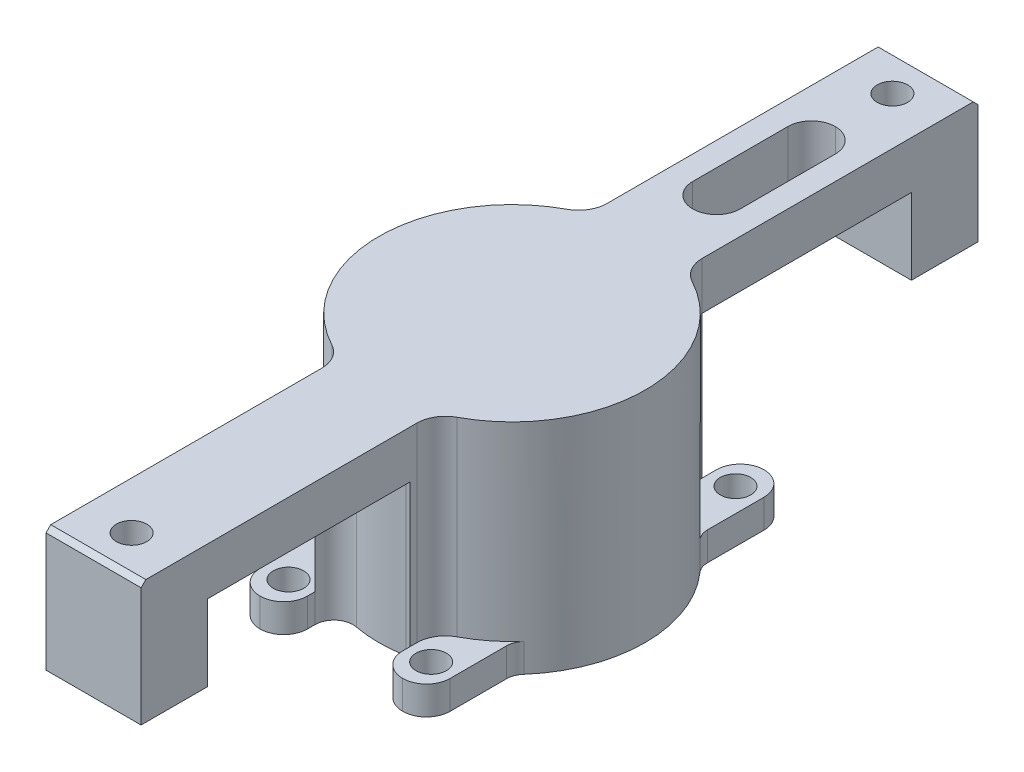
ISO-10303-21;
HEADER;
FILE_DESCRIPTION(('STEP AP214'),'2;1');
FILE_NAME('part.step','',(''),(''),'','','');
FILE_SCHEMA(('AUTOMOTIVE_DESIGN { 1 0 10303 214 1 1 1 1 }'));
ENDSEC;
DATA;
#1=APPLICATION_CONTEXT('core data for automotive mechanical design processes');
#2=APPLICATION_PROTOCOL_DEFINITION('international standard','automotive_design',2000,#1);
#3=PRODUCT_CONTEXT('',#1,'mechanical');
#4=PRODUCT('Part','Part','',(#3));
#5=PRODUCT_RELATED_PRODUCT_CATEGORY('part','',(#4));
#6=PRODUCT_DEFINITION_FORMATION('','',#4);
#7=PRODUCT_DEFINITION_CONTEXT('part definition',#1,'design');
#8=PRODUCT_DEFINITION('design','',#6,#7);
#9=PRODUCT_DEFINITION_SHAPE('','',#8);
#10=(LENGTH_UNIT() NAMED_UNIT(*) SI_UNIT(.MILLI.,.METRE.));
#11=(NAMED_UNIT(*) PLANE_ANGLE_UNIT() SI_UNIT($,.RADIAN.));
#12=(NAMED_UNIT(*) SI_UNIT($,.STERADIAN.) SOLID_ANGLE_UNIT());
#13=UNCERTAINTY_MEASURE_WITH_UNIT(LENGTH_MEASURE(1.E-05),#10,'distance_accuracy_value','');
#14=(GEOMETRIC_REPRESENTATION_CONTEXT(3) GLOBAL_UNCERTAINTY_ASSIGNED_CONTEXT((#13)) GLOBAL_UNIT_ASSIGNED_CONTEXT((#10,
#11,#12)) REPRESENTATION_CONTEXT('',''));
#15=CARTESIAN_POINT('',(0.,0.,0.));
#16=DIRECTION('',(0.,0.,1.));
#17=DIRECTION('',(1.,0.,0.));
#18=AXIS2_PLACEMENT_3D('',#15,#16,#17);
#19=CARTESIAN_POINT('',(-4.99999999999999,18.,43.));
#20=DIRECTION('',(-1.,0.,0.));
#21=DIRECTION('',(0.,0.,1.));
#22=AXIS2_PLACEMENT_3D('',#19,#20,#21);
#23=PLANE('',#22);
#24=DIRECTION('',(0.,-1.,0.));
#25=VECTOR('',#24,1.);
#26=CARTESIAN_POINT('',(-4.99999999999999,23.,44.));
#27=LINE('',#26,#25);
#28=CARTESIAN_POINT('',(-4.99999999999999,22.5,44.));
#29=VERTEX_POINT('',#28);
#30=CARTESIAN_POINT('',(-4.99999999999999,10.,44.));
#31=VERTEX_POINT('',#30);
#32=EDGE_CURVE('E383',#29,#31,#27,.T.);
#33=ORIENTED_EDGE('',*,*,#32,.F.);
#34=DIRECTION('',(0.,-0.707106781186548,0.707106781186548));
#35=VECTOR('',#34,1.);
#36=CARTESIAN_POINT('',(-4.99999999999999,20.75,45.75));
#37=LINE('',#36,#35);
#38=CARTESIAN_POINT('',(-4.99999999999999,23.,43.5));
#39=VERTEX_POINT('',#38);
#40=EDGE_CURVE('E44',#29,#39,#37,.F.);
#41=ORIENTED_EDGE('',*,*,#40,.T.);
#42=DIRECTION('',(0.,0.,1.));
#43=VECTOR('',#42,1.);
#44=CARTESIAN_POINT('',(-4.99999999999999,23.,43.));
#45=LINE('',#44,#43);
#46=CARTESIAN_POINT('',(-4.99999999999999,23.,15.));
#47=VERTEX_POINT('',#46);
#48=EDGE_CURVE('E521',#47,#39,#45,.T.);
#49=ORIENTED_EDGE('',*,*,#48,.F.);
#50=DIRECTION('',(0.,1.,0.));
#51=VECTOR('',#50,1.);
#52=CARTESIAN_POINT('',(-4.99999999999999,-0.0869745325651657,15.));
#53=LINE('',#52,#51);
#54=CARTESIAN_POINT('',(-5.,3.,15.));
#55=VERTEX_POINT('',#54);
#56=EDGE_CURVE('E486',#55,#47,#53,.T.);
#57=ORIENTED_EDGE('',*,*,#56,.F.);
#58=DIRECTION('',(0.,0.,1.));
#59=VECTOR('',#58,1.);
#60=CARTESIAN_POINT('',(-5.,3.,15.7162336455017));
#61=LINE('',#60,#59);
#62=CARTESIAN_POINT('',(-5.,3.,15.7162336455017));
#63=VERTEX_POINT('',#62);
#64=EDGE_CURVE('E495',#55,#63,#61,.T.);
#65=ORIENTED_EDGE('',*,*,#64,.T.);
#66=DIRECTION('',(0.,-1.,0.));
#67=VECTOR('',#66,1.);
#68=CARTESIAN_POINT('',(-5.,21.5507435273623,15.7162336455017));
#69=LINE('',#68,#67);
#70=CARTESIAN_POINT('',(-4.99999999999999,18.,15.7162336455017));
#71=VERTEX_POINT('',#70);
#72=EDGE_CURVE('E505',#71,#63,#69,.T.);
#73=ORIENTED_EDGE('',*,*,#72,.F.);
#74=DIRECTION('',(0.,0.,1.));
#75=VECTOR('',#74,1.);
#76=CARTESIAN_POINT('',(-4.99999999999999,18.,43.));
#77=LINE('',#76,#75);
#78=CARTESIAN_POINT('',(-4.99999999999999,18.,37.));
#79=VERTEX_POINT('',#78);
#80=EDGE_CURVE('E524',#71,#79,#77,.T.);
#81=ORIENTED_EDGE('',*,*,#80,.T.);
#82=DIRECTION('',(0.,1.,0.));
#83=VECTOR('',#82,1.);
#84=CARTESIAN_POINT('',(-4.99999999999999,8.,37.));
#85=LINE('',#84,#83);
#86=CARTESIAN_POINT('',(-4.99999999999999,10.,37.));
#87=VERTEX_POINT('',#86);
#88=EDGE_CURVE('E394',#87,#79,#85,.T.);
#89=ORIENTED_EDGE('',*,*,#88,.F.);
#90=DIRECTION('',(0.,0.,-1.));
#91=VECTOR('',#90,1.);
#92=CARTESIAN_POINT('',(-4.99999999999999,10.,43.));
#93=LINE('',#92,#91);
#94=EDGE_CURVE('E392',#31,#87,#93,.T.);
#95=ORIENTED_EDGE('',*,*,#94,.F.);
#96=EDGE_LOOP('',(#33,#41,#49,#57,#65,#73,#81,#89,#95));
#97=FACE_BOUND('',#96,.T.);
#98=ADVANCED_FACE('F36',(#97),#23,.T.);
#99=CARTESIAN_POINT('',(5.,18.,13.076696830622));
#100=DIRECTION('',(1.,0.,0.));
#101=DIRECTION('',(0.,0.,-1.));
#102=AXIS2_PLACEMENT_3D('',#99,#100,#101);
#103=PLANE('',#102);
#104=DIRECTION('',(0.,0.,-1.));
#105=VECTOR('',#104,1.);
#106=CARTESIAN_POINT('',(5.,23.,13.076696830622));
#107=LINE('',#106,#105);
#108=CARTESIAN_POINT('',(5.00000000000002,23.,43.5));
#109=VERTEX_POINT('',#108);
#110=CARTESIAN_POINT('',(5.00000000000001,23.,15.));
#111=VERTEX_POINT('',#110);
#112=EDGE_CURVE('E525',#109,#111,#107,.T.);
#113=ORIENTED_EDGE('',*,*,#112,.F.);
#114=DIRECTION('',(0.,0.707106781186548,-0.707106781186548));
#115=VECTOR('',#114,1.);
#116=CARTESIAN_POINT('',(5.00000000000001,35.711651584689,30.788348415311));
#117=LINE('',#116,#115);
#118=CARTESIAN_POINT('',(5.00000000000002,22.5,44.));
#119=VERTEX_POINT('',#118);
#120=EDGE_CURVE('E11',#109,#119,#117,.F.);
#121=ORIENTED_EDGE('',*,*,#120,.T.);
#122=DIRECTION('',(0.,1.,0.));
#123=VECTOR('',#122,1.);
#124=CARTESIAN_POINT('',(5.00000000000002,10.,44.));
#125=LINE('',#124,#123);
#126=CARTESIAN_POINT('',(5.00000000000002,10.,44.));
#127=VERTEX_POINT('',#126);
#128=EDGE_CURVE('E404',#127,#119,#125,.T.);
#129=ORIENTED_EDGE('',*,*,#128,.F.);
#130=DIRECTION('',(0.,0.,1.));
#131=VECTOR('',#130,1.);
#132=CARTESIAN_POINT('',(5.00000000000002,10.,37.));
#133=LINE('',#132,#131);
#134=CARTESIAN_POINT('',(5.00000000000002,10.,37.));
#135=VERTEX_POINT('',#134);
#136=EDGE_CURVE('E403',#135,#127,#133,.T.);
#137=ORIENTED_EDGE('',*,*,#136,.F.);
#138=DIRECTION('',(0.,1.,0.));
#139=VECTOR('',#138,1.);
#140=CARTESIAN_POINT('',(5.00000000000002,8.,37.));
#141=LINE('',#140,#139);
#142=CARTESIAN_POINT('',(5.00000000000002,18.,37.));
#143=VERTEX_POINT('',#142);
#144=EDGE_CURVE('E511',#135,#143,#141,.T.);
#145=ORIENTED_EDGE('',*,*,#144,.T.);
#146=DIRECTION('',(0.,0.,-1.));
#147=VECTOR('',#146,1.);
#148=CARTESIAN_POINT('',(5.,18.,13.076696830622));
#149=LINE('',#148,#147);
#150=CARTESIAN_POINT('',(5.,18.,15.7162336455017));
#151=VERTEX_POINT('',#150);
#152=EDGE_CURVE('E527',#143,#151,#149,.T.);
#153=ORIENTED_EDGE('',*,*,#152,.T.);
#154=DIRECTION('',(0.,-1.,0.));
#155=VECTOR('',#154,1.);
#156=CARTESIAN_POINT('',(5.,21.5507435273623,15.7162336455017));
#157=LINE('',#156,#155);
#158=CARTESIAN_POINT('',(5.,3.,15.7162336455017));
#159=VERTEX_POINT('',#158);
#160=EDGE_CURVE('E496',#151,#159,#157,.T.);
#161=ORIENTED_EDGE('',*,*,#160,.T.);
#162=DIRECTION('',(0.,0.,1.));
#163=VECTOR('',#162,1.);
#164=CARTESIAN_POINT('',(5.,3.,15.7162336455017));
#165=LINE('',#164,#163);
#166=CARTESIAN_POINT('',(5.,3.,15.));
#167=VERTEX_POINT('',#166);
#168=EDGE_CURVE('E491',#167,#159,#165,.T.);
#169=ORIENTED_EDGE('',*,*,#168,.F.);
#170=DIRECTION('',(0.,1.,0.));
#171=VECTOR('',#170,1.);
#172=CARTESIAN_POINT('',(5.00000000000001,-0.0869745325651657,15.));
#173=LINE('',#172,#171);
#174=EDGE_CURVE('E478',#167,#111,#173,.T.);
#175=ORIENTED_EDGE('',*,*,#174,.T.);
#176=EDGE_LOOP('',(#113,#121,#129,#137,#145,#153,#161,#169,#175));
#177=FACE_BOUND('',#176,.T.);
#178=ADVANCED_FACE('F851',(#177),#103,.T.);
#179=CARTESIAN_POINT('',(-4.99999999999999,8.,37.));
#180=DIRECTION('',(0.,0.,1.));
#181=DIRECTION('',(1.,0.,0.));
#182=AXIS2_PLACEMENT_3D('',#179,#180,#181);
#183=PLANE('',#182);
#184=DIRECTION('',(1.,0.,0.));
#185=VECTOR('',#184,1.);
#186=CARTESIAN_POINT('',(-4.99999999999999,10.,37.));
#187=LINE('',#186,#185);
#188=EDGE_CURVE('E397',#87,#135,#187,.T.);
#189=ORIENTED_EDGE('',*,*,#188,.F.);
#190=ORIENTED_EDGE('',*,*,#88,.T.);
#191=DIRECTION('',(1.,0.,0.));
#192=VECTOR('',#191,1.);
#193=CARTESIAN_POINT('',(-4.99999999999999,18.,37.));
#194=LINE('',#193,#192);
#195=EDGE_CURVE('E504',#79,#143,#194,.T.);
#196=ORIENTED_EDGE('',*,*,#195,.T.);
#197=ORIENTED_EDGE('',*,*,#144,.F.);
#198=EDGE_LOOP('',(#189,#190,#196,#197));
#199=FACE_BOUND('',#198,.T.);
#200=ADVANCED_FACE('F856',(#199),#183,.F.);
#201=CARTESIAN_POINT('',(0.,0.,40.));
#202=DIRECTION('',(0.,1.,0.));
#203=DIRECTION('',(0.,0.,1.));
#204=AXIS2_PLACEMENT_3D('',#201,#202,#203);
#205=CYLINDRICAL_SURFACE('',#204,1.6);
#206=CARTESIAN_POINT('',(0.,23.,40.));
#207=DIRECTION('',(0.,1.,0.));
#208=DIRECTION('',(0.,0.,-1.));
#209=AXIS2_PLACEMENT_3D('',#206,#207,#208);
#210=CIRCLE('',#209,1.6);
#211=CARTESIAN_POINT('',(0.,23.,38.4));
#212=VERTEX_POINT('',#211);
#213=EDGE_CURVE('E438',#212,#212,#210,.T.);
#214=ORIENTED_EDGE('',*,*,#213,.T.);
#215=EDGE_LOOP('',(#214));
#216=FACE_BOUND('',#215,.T.);
#217=CARTESIAN_POINT('',(0.,10.,40.));
#218=DIRECTION('',(0.,-1.,0.));
#219=DIRECTION('',(0.,0.,-1.));
#220=AXIS2_PLACEMENT_3D('',#217,#218,#219);
#221=CIRCLE('',#220,1.6);
#222=CARTESIAN_POINT('',(0.,10.,38.4));
#223=VERTEX_POINT('',#222);
#224=EDGE_CURVE('E417',#223,#223,#221,.F.);
#225=ORIENTED_EDGE('',*,*,#224,.F.);
#226=EDGE_LOOP('',(#225));
#227=FACE_BOUND('',#226,.T.);
#228=ADVANCED_FACE('F874',(#216,#227),#205,.F.);
#229=CARTESIAN_POINT('',(5.,18.,-13.076696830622));
#230=DIRECTION('',(1.,0.,0.));
#231=DIRECTION('',(0.,0.,-1.));
#232=AXIS2_PLACEMENT_3D('',#229,#230,#231);
#233=PLANE('',#232);
#234=DIRECTION('',(0.,-1.,0.));
#235=VECTOR('',#234,1.);
#236=CARTESIAN_POINT('',(5.00000000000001,23.,-44.));
#237=LINE('',#236,#235);
#238=CARTESIAN_POINT('',(5.00000000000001,22.5,-44.));
#239=VERTEX_POINT('',#238);
#240=CARTESIAN_POINT('',(5.,10.,-44.));
#241=VERTEX_POINT('',#240);
#242=EDGE_CURVE('E406',#239,#241,#237,.T.);
#243=ORIENTED_EDGE('',*,*,#242,.F.);
#244=DIRECTION('',(0.,-0.707106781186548,-0.707106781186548));
#245=VECTOR('',#244,1.);
#246=CARTESIAN_POINT('',(5.00000000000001,35.711651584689,-30.788348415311));
#247=LINE('',#246,#245);
#248=CARTESIAN_POINT('',(5.00000000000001,23.,-43.5));
#249=VERTEX_POINT('',#248);
#250=EDGE_CURVE('E831',#239,#249,#247,.F.);
#251=ORIENTED_EDGE('',*,*,#250,.T.);
#252=DIRECTION('',(0.,0.,-1.));
#253=VECTOR('',#252,1.);
#254=CARTESIAN_POINT('',(5.,23.,-13.076696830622));
#255=LINE('',#254,#253);
#256=CARTESIAN_POINT('',(5.,23.,-15.));
#257=VERTEX_POINT('',#256);
#258=EDGE_CURVE('E530',#257,#249,#255,.T.);
#259=ORIENTED_EDGE('',*,*,#258,.F.);
#260=DIRECTION('',(0.,1.,0.));
#261=VECTOR('',#260,1.);
#262=CARTESIAN_POINT('',(5.,-0.0869745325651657,-15.));
#263=LINE('',#262,#261);
#264=CARTESIAN_POINT('',(5.,18.,-15.));
#265=VERTEX_POINT('',#264);
#266=EDGE_CURVE('E750',#257,#265,#263,.F.);
#267=ORIENTED_EDGE('',*,*,#266,.T.);
#268=DIRECTION('',(0.,0.,-1.));
#269=VECTOR('',#268,1.);
#270=CARTESIAN_POINT('',(5.,18.,-13.076696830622));
#271=LINE('',#270,#269);
#272=CARTESIAN_POINT('',(5.00000000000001,18.,-37.));
#273=VERTEX_POINT('',#272);
#274=EDGE_CURVE('E537',#265,#273,#271,.T.);
#275=ORIENTED_EDGE('',*,*,#274,.T.);
#276=DIRECTION('',(0.,1.,0.));
#277=VECTOR('',#276,1.);
#278=CARTESIAN_POINT('',(5.,8.,-37.));
#279=LINE('',#278,#277);
#280=CARTESIAN_POINT('',(5.,10.,-37.));
#281=VERTEX_POINT('',#280);
#282=EDGE_CURVE('E519',#281,#273,#279,.T.);
#283=ORIENTED_EDGE('',*,*,#282,.F.);
#284=DIRECTION('',(0.,0.,1.));
#285=VECTOR('',#284,1.);
#286=CARTESIAN_POINT('',(5.,10.,-43.));
#287=LINE('',#286,#285);
#288=EDGE_CURVE('E422',#241,#281,#287,.T.);
#289=ORIENTED_EDGE('',*,*,#288,.F.);
#290=EDGE_LOOP('',(#243,#251,#259,#267,#275,#283,#289));
#291=FACE_BOUND('',#290,.T.);
#292=ADVANCED_FACE('F870',(#291),#233,.T.);
#293=CARTESIAN_POINT('',(-5.,18.,-43.));
#294=DIRECTION('',(-1.,0.,0.));
#295=DIRECTION('',(0.,0.,1.));
#296=AXIS2_PLACEMENT_3D('',#293,#294,#295);
#297=PLANE('',#296);
#298=DIRECTION('',(0.,0.,1.));
#299=VECTOR('',#298,1.);
#300=CARTESIAN_POINT('',(-5.,23.,-43.));
#301=LINE('',#300,#299);
#302=CARTESIAN_POINT('',(-5.,23.,-43.5));
#303=VERTEX_POINT('',#302);
#304=CARTESIAN_POINT('',(-4.99999999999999,23.,-15.));
#305=VERTEX_POINT('',#304);
#306=EDGE_CURVE('E538',#303,#305,#301,.T.);
#307=ORIENTED_EDGE('',*,*,#306,.F.);
#308=DIRECTION('',(0.,0.707106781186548,0.707106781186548));
#309=VECTOR('',#308,1.);
#310=CARTESIAN_POINT('',(-5.,20.75,-45.75));
#311=LINE('',#310,#309);
#312=CARTESIAN_POINT('',(-5.,22.5,-44.));
#313=VERTEX_POINT('',#312);
#314=EDGE_CURVE('E837',#303,#313,#311,.F.);
#315=ORIENTED_EDGE('',*,*,#314,.T.);
#316=DIRECTION('',(0.,1.,0.));
#317=VECTOR('',#316,1.);
#318=CARTESIAN_POINT('',(-5.,10.,-44.));
#319=LINE('',#318,#317);
#320=CARTESIAN_POINT('',(-5.,10.,-44.));
#321=VERTEX_POINT('',#320);
#322=EDGE_CURVE('E398',#321,#313,#319,.T.);
#323=ORIENTED_EDGE('',*,*,#322,.F.);
#324=DIRECTION('',(0.,0.,-1.));
#325=VECTOR('',#324,1.);
#326=CARTESIAN_POINT('',(-5.,10.,-37.));
#327=LINE('',#326,#325);
#328=CARTESIAN_POINT('',(-5.,10.,-37.));
#329=VERTEX_POINT('',#328);
#330=EDGE_CURVE('E420',#329,#321,#327,.T.);
#331=ORIENTED_EDGE('',*,*,#330,.F.);
#332=DIRECTION('',(0.,1.,0.));
#333=VECTOR('',#332,1.);
#334=CARTESIAN_POINT('',(-5.,8.,-37.));
#335=LINE('',#334,#333);
#336=CARTESIAN_POINT('',(-5.,18.,-37.));
#337=VERTEX_POINT('',#336);
#338=EDGE_CURVE('E517',#329,#337,#335,.T.);
#339=ORIENTED_EDGE('',*,*,#338,.T.);
#340=DIRECTION('',(0.,0.,1.));
#341=VECTOR('',#340,1.);
#342=CARTESIAN_POINT('',(-5.,18.,-43.));
#343=LINE('',#342,#341);
#344=CARTESIAN_POINT('',(-4.99999999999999,18.,-15.));
#345=VERTEX_POINT('',#344);
#346=EDGE_CURVE('E541',#337,#345,#343,.T.);
#347=ORIENTED_EDGE('',*,*,#346,.T.);
#348=DIRECTION('',(0.,1.,0.));
#349=VECTOR('',#348,1.);
#350=CARTESIAN_POINT('',(-5.,-0.0869745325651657,-15.));
#351=LINE('',#350,#349);
#352=EDGE_CURVE('E738',#345,#305,#351,.T.);
#353=ORIENTED_EDGE('',*,*,#352,.T.);
#354=EDGE_LOOP('',(#307,#315,#323,#331,#339,#347,#353));
#355=FACE_BOUND('',#354,.T.);
#356=ADVANCED_FACE('F866',(#355),#297,.T.);
#357=CARTESIAN_POINT('',(-5.,8.,-37.));
#358=DIRECTION('',(0.,0.,-1.));
#359=DIRECTION('',(-1.,0.,0.));
#360=AXIS2_PLACEMENT_3D('',#357,#358,#359);
#361=PLANE('',#360);
#362=DIRECTION('',(-1.,0.,0.));
#363=VECTOR('',#362,1.);
#364=CARTESIAN_POINT('',(5.,10.,-37.));
#365=LINE('',#364,#363);
#366=EDGE_CURVE('E418',#281,#329,#365,.T.);
#367=ORIENTED_EDGE('',*,*,#366,.F.);
#368=ORIENTED_EDGE('',*,*,#282,.T.);
#369=DIRECTION('',(-1.,0.,0.));
#370=VECTOR('',#369,1.);
#371=CARTESIAN_POINT('',(-5.,18.,-37.));
#372=LINE('',#371,#370);
#373=EDGE_CURVE('E514',#273,#337,#372,.T.);
#374=ORIENTED_EDGE('',*,*,#373,.T.);
#375=ORIENTED_EDGE('',*,*,#338,.F.);
#376=EDGE_LOOP('',(#367,#368,#374,#375));
#377=FACE_BOUND('',#376,.T.);
#378=ADVANCED_FACE('F869',(#377),#361,.F.);
#379=CARTESIAN_POINT('',(0.,0.,-40.));
#380=DIRECTION('',(0.,1.,0.));
#381=DIRECTION('',(0.,0.,1.));
#382=AXIS2_PLACEMENT_3D('',#379,#380,#381);
#383=CYLINDRICAL_SURFACE('',#382,1.6);
#384=CARTESIAN_POINT('',(0.,23.,-40.));
#385=DIRECTION('',(0.,1.,0.));
#386=DIRECTION('',(0.,0.,1.));
#387=AXIS2_PLACEMENT_3D('',#384,#385,#386);
#388=CIRCLE('',#387,1.6);
#389=CARTESIAN_POINT('',(0.,23.,-38.4));
#390=VERTEX_POINT('',#389);
#391=EDGE_CURVE('E441',#390,#390,#388,.T.);
#392=ORIENTED_EDGE('',*,*,#391,.T.);
#393=EDGE_LOOP('',(#392));
#394=FACE_BOUND('',#393,.T.);
#395=CARTESIAN_POINT('',(0.,10.,-40.));
#396=DIRECTION('',(0.,-1.,0.));
#397=DIRECTION('',(0.,0.,-1.));
#398=AXIS2_PLACEMENT_3D('',#395,#396,#397);
#399=CIRCLE('',#398,1.6);
#400=CARTESIAN_POINT('',(0.,10.,-41.6));
#401=VERTEX_POINT('',#400);
#402=EDGE_CURVE('E424',#401,#401,#399,.F.);
#403=ORIENTED_EDGE('',*,*,#402,.F.);
#404=EDGE_LOOP('',(#403));
#405=FACE_BOUND('',#404,.T.);
#406=ADVANCED_FACE('F1075',(#394,#405),#383,.F.);
#407=CARTESIAN_POINT('',(0.,22.,0.));
#408=DIRECTION('',(0.,-1.,0.));
#409=DIRECTION('',(0.,0.,-1.));
#410=AXIS2_PLACEMENT_3D('',#407,#408,#409);
#411=CYLINDRICAL_SURFACE('',#410,14.);
#412=CARTESIAN_POINT('',(0.,18.,0.));
#413=DIRECTION('',(0.,-1.,0.));
#414=DIRECTION('',(0.,0.,1.));
#415=AXIS2_PLACEMENT_3D('',#412,#413,#414);
#416=CIRCLE('',#415,14.);
#417=CARTESIAN_POINT('',(-2.7331345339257,18.,-13.7306218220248));
#418=VERTEX_POINT('',#417);
#419=CARTESIAN_POINT('',(2.7331345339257,18.,-13.7306218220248));
#420=VERTEX_POINT('',#419);
#421=EDGE_CURVE('E534',#418,#420,#416,.T.);
#422=ORIENTED_EDGE('',*,*,#421,.T.);
#423=DIRECTION('',(0.,-1.,0.));
#424=VECTOR('',#423,1.);
#425=CARTESIAN_POINT('',(2.7331345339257,22.,-13.7306218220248));
#426=LINE('',#425,#424);
#427=CARTESIAN_POINT('',(2.7331345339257,6.,-13.7306218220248));
#428=VERTEX_POINT('',#427);
#429=EDGE_CURVE('E786',#420,#428,#426,.T.);
#430=ORIENTED_EDGE('',*,*,#429,.T.);
#431=CARTESIAN_POINT('',(0.,6.,0.));
#432=DIRECTION('',(0.,1.,0.));
#433=DIRECTION('',(0.,0.,1.));
#434=AXIS2_PLACEMENT_3D('',#431,#432,#433);
#435=CIRCLE('',#434,14.);
#436=CARTESIAN_POINT('',(-2.7331345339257,6.,-13.7306218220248));
#437=VERTEX_POINT('',#436);
#438=EDGE_CURVE('E572',#428,#437,#435,.T.);
#439=ORIENTED_EDGE('',*,*,#438,.T.);
#440=DIRECTION('',(0.,-1.,0.));
#441=VECTOR('',#440,1.);
#442=CARTESIAN_POINT('',(-2.7331345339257,22.,-13.7306218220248));
#443=LINE('',#442,#441);
#444=EDGE_CURVE('E783',#437,#418,#443,.F.);
#445=ORIENTED_EDGE('',*,*,#444,.T.);
#446=EDGE_LOOP('',(#422,#430,#439,#445));
#447=FACE_BOUND('',#446,.T.);
#448=ADVANCED_FACE('F966',(#447),#411,.T.);
#449=DIRECTION('',(0.,1.,0.));
#450=VECTOR('',#449,1.);
#451=CARTESIAN_POINT('',(-6.58823529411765,-0.0869745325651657,-12.3529411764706));
#452=LINE('',#451,#450);
#453=CARTESIAN_POINT('',(-6.58823529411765,3.,-12.3529411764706));
#454=VERTEX_POINT('',#453);
#455=CARTESIAN_POINT('',(-6.58823529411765,23.,-12.3529411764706));
#456=VERTEX_POINT('',#455);
#457=EDGE_CURVE('E457',#454,#456,#452,.T.);
#458=ORIENTED_EDGE('',*,*,#457,.F.);
#459=CARTESIAN_POINT('',(0.,3.,0.));
#460=DIRECTION('',(0.,1.,0.));
#461=DIRECTION('',(0.,0.,1.));
#462=AXIS2_PLACEMENT_3D('',#459,#460,#461);
#463=CIRCLE('',#462,14.);
#464=CARTESIAN_POINT('',(-10.5,3.,-9.26012958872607));
#465=VERTEX_POINT('',#464);
#466=EDGE_CURVE('E576',#454,#465,#463,.T.);
#467=ORIENTED_EDGE('',*,*,#466,.T.);
#468=DIRECTION('',(0.,-1.,0.));
#469=VECTOR('',#468,1.);
#470=CARTESIAN_POINT('',(-10.5,22.,-9.26012958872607));
#471=LINE('',#470,#469);
#472=CARTESIAN_POINT('',(-10.5,0.,-9.26012958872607));
#473=VERTEX_POINT('',#472);
#474=EDGE_CURVE('E687',#465,#473,#471,.T.);
#475=ORIENTED_EDGE('',*,*,#474,.T.);
#476=CARTESIAN_POINT('',(0.,0.,0.));
#477=DIRECTION('',(0.,1.,0.));
#478=DIRECTION('',(0.,0.,1.));
#479=AXIS2_PLACEMENT_3D('',#476,#477,#478);
#480=CIRCLE('',#479,14.);
#481=CARTESIAN_POINT('',(-10.5,0.,9.26012958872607));
#482=VERTEX_POINT('',#481);
#483=EDGE_CURVE('E634',#473,#482,#480,.T.);
#484=ORIENTED_EDGE('',*,*,#483,.T.);
#485=DIRECTION('',(0.,-1.,0.));
#486=VECTOR('',#485,1.);
#487=CARTESIAN_POINT('',(-10.5,22.,9.26012958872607));
#488=LINE('',#487,#486);
#489=CARTESIAN_POINT('',(-10.5,3.,9.26012958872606));
#490=VERTEX_POINT('',#489);
#491=EDGE_CURVE('E690',#482,#490,#488,.F.);
#492=ORIENTED_EDGE('',*,*,#491,.T.);
#493=CARTESIAN_POINT('',(0.,3.,0.));
#494=DIRECTION('',(0.,1.,0.));
#495=DIRECTION('',(0.,0.,-1.));
#496=AXIS2_PLACEMENT_3D('',#493,#494,#495);
#497=CIRCLE('',#496,14.);
#498=CARTESIAN_POINT('',(-6.58823529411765,3.,12.3529411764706));
#499=VERTEX_POINT('',#498);
#500=EDGE_CURVE('E611',#490,#499,#497,.T.);
#501=ORIENTED_EDGE('',*,*,#500,.T.);
#502=DIRECTION('',(0.,1.,0.));
#503=VECTOR('',#502,1.);
#504=CARTESIAN_POINT('',(-6.58823529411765,-0.0869745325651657,12.3529411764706));
#505=LINE('',#504,#503);
#506=CARTESIAN_POINT('',(-6.58823529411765,23.,12.3529411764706));
#507=VERTEX_POINT('',#506);
#508=EDGE_CURVE('E488',#499,#507,#505,.T.);
#509=ORIENTED_EDGE('',*,*,#508,.T.);
#510=CARTESIAN_POINT('',(0.,23.,0.));
#511=DIRECTION('',(0.,1.,0.));
#512=DIRECTION('',(0.,0.,1.));
#513=AXIS2_PLACEMENT_3D('',#510,#511,#512);
#514=CIRCLE('',#513,14.);
#515=EDGE_CURVE('E626',#456,#507,#514,.T.);
#516=ORIENTED_EDGE('',*,*,#515,.F.);
#517=EDGE_LOOP('',(#458,#467,#475,#484,#492,#501,#509,#516));
#518=FACE_BOUND('',#517,.T.);
#519=ADVANCED_FACE('F963',(#518),#411,.T.);
#520=CARTESIAN_POINT('',(0.,3.,0.));
#521=DIRECTION('',(0.,1.,0.));
#522=DIRECTION('',(0.,0.,-1.));
#523=AXIS2_PLACEMENT_3D('',#520,#521,#522);
#524=CIRCLE('',#523,14.);
#525=CARTESIAN_POINT('',(10.5,3.,-9.26012958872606));
#526=VERTEX_POINT('',#525);
#527=CARTESIAN_POINT('',(6.58823529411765,3.,-12.3529411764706));
#528=VERTEX_POINT('',#527);
#529=EDGE_CURVE('E586',#526,#528,#524,.T.);
#530=ORIENTED_EDGE('',*,*,#529,.T.);
#531=DIRECTION('',(0.,1.,0.));
#532=VECTOR('',#531,1.);
#533=CARTESIAN_POINT('',(6.58823529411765,-0.0869745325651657,-12.3529411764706));
#534=LINE('',#533,#532);
#535=CARTESIAN_POINT('',(6.58823529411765,23.,-12.3529411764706));
#536=VERTEX_POINT('',#535);
#537=EDGE_CURVE('E454',#528,#536,#534,.T.);
#538=ORIENTED_EDGE('',*,*,#537,.T.);
#539=CARTESIAN_POINT('',(6.58823529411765,23.,12.3529411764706));
#540=VERTEX_POINT('',#539);
#541=EDGE_CURVE('E621',#540,#536,#514,.T.);
#542=ORIENTED_EDGE('',*,*,#541,.F.);
#543=DIRECTION('',(0.,1.,0.));
#544=VECTOR('',#543,1.);
#545=CARTESIAN_POINT('',(6.58823529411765,-0.0869745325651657,12.3529411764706));
#546=LINE('',#545,#544);
#547=CARTESIAN_POINT('',(6.58823529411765,3.,12.3529411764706));
#548=VERTEX_POINT('',#547);
#549=EDGE_CURVE('E475',#548,#540,#546,.T.);
#550=ORIENTED_EDGE('',*,*,#549,.F.);
#551=CARTESIAN_POINT('',(0.,3.,0.));
#552=DIRECTION('',(0.,1.,0.));
#553=DIRECTION('',(0.,0.,1.));
#554=AXIS2_PLACEMENT_3D('',#551,#552,#553);
#555=CIRCLE('',#554,14.);
#556=CARTESIAN_POINT('',(10.5,3.,9.26012958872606));
#557=VERTEX_POINT('',#556);
#558=EDGE_CURVE('E603',#548,#557,#555,.T.);
#559=ORIENTED_EDGE('',*,*,#558,.T.);
#560=DIRECTION('',(0.,-1.,0.));
#561=VECTOR('',#560,1.);
#562=CARTESIAN_POINT('',(10.5,22.,9.26012958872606));
#563=LINE('',#562,#561);
#564=CARTESIAN_POINT('',(10.5,0.,9.26012958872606));
#565=VERTEX_POINT('',#564);
#566=EDGE_CURVE('E681',#557,#565,#563,.T.);
#567=ORIENTED_EDGE('',*,*,#566,.T.);
#568=CARTESIAN_POINT('',(10.5,0.,-9.26012958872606));
#569=VERTEX_POINT('',#568);
#570=EDGE_CURVE('E635',#565,#569,#480,.T.);
#571=ORIENTED_EDGE('',*,*,#570,.T.);
#572=DIRECTION('',(0.,-1.,0.));
#573=VECTOR('',#572,1.);
#574=CARTESIAN_POINT('',(10.5,22.,-9.26012958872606));
#575=LINE('',#574,#573);
#576=EDGE_CURVE('E684',#569,#526,#575,.F.);
#577=ORIENTED_EDGE('',*,*,#576,.T.);
#578=EDGE_LOOP('',(#530,#538,#542,#550,#559,#567,#571,#577));
#579=FACE_BOUND('',#578,.T.);
#580=ADVANCED_FACE('F902',(#579),#411,.T.);
#581=CARTESIAN_POINT('',(0.,3.,0.));
#582=DIRECTION('',(0.,1.,0.));
#583=DIRECTION('',(0.,0.,1.));
#584=AXIS2_PLACEMENT_3D('',#581,#582,#583);
#585=PLANE('',#584);
#586=CARTESIAN_POINT('',(-7.5,3.,-16.));
#587=DIRECTION('',(0.,1.,0.));
#588=DIRECTION('',(0.,0.,1.));
#589=AXIS2_PLACEMENT_3D('',#586,#587,#588);
#590=CIRCLE('',#589,1.6);
#591=CARTESIAN_POINT('',(-7.5,3.,-14.4));
#592=VERTEX_POINT('',#591);
#593=EDGE_CURVE('E560',#592,#592,#590,.T.);
#594=ORIENTED_EDGE('',*,*,#593,.F.);
#595=EDGE_LOOP('',(#594));
#596=FACE_BOUND('',#595,.T.);
#597=DIRECTION('',(0.,0.,1.));
#598=VECTOR('',#597,1.);
#599=CARTESIAN_POINT('',(-4.99999999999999,3.,-13.076696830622));
#600=LINE('',#599,#598);
#601=CARTESIAN_POINT('',(-4.99999999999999,3.,-16.5));
#602=VERTEX_POINT('',#601);
#603=CARTESIAN_POINT('',(-4.99999999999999,3.,-15.));
#604=VERTEX_POINT('',#603);
#605=EDGE_CURVE('E581',#602,#604,#600,.T.);
#606=ORIENTED_EDGE('',*,*,#605,.F.);
#607=CARTESIAN_POINT('',(-7.49999999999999,3.,-16.5));
#608=DIRECTION('',(0.,1.,0.));
#609=DIRECTION('',(0.,0.,1.));
#610=AXIS2_PLACEMENT_3D('',#607,#608,#609);
#611=CIRCLE('',#610,2.5);
#612=CARTESIAN_POINT('',(-7.49999999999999,3.,-19.));
#613=VERTEX_POINT('',#612);
#614=EDGE_CURVE('E763',#602,#613,#611,.T.);
#615=ORIENTED_EDGE('',*,*,#614,.T.);
#616=CARTESIAN_POINT('',(-7.49999999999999,3.,-16.5));
#617=DIRECTION('',(0.,1.,0.));
#618=DIRECTION('',(0.,0.,1.));
#619=AXIS2_PLACEMENT_3D('',#616,#617,#618);
#620=CIRCLE('',#619,2.5);
#621=CARTESIAN_POINT('',(-9.99999999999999,3.,-16.5));
#622=VERTEX_POINT('',#621);
#623=EDGE_CURVE('E678',#613,#622,#620,.T.);
#624=ORIENTED_EDGE('',*,*,#623,.T.);
#625=DIRECTION('',(0.,0.,-1.));
#626=VECTOR('',#625,1.);
#627=CARTESIAN_POINT('',(-9.99999999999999,3.,-19.));
#628=LINE('',#627,#626);
#629=CARTESIAN_POINT('',(-9.99999999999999,3.,-10.5830052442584));
#630=VERTEX_POINT('',#629);
#631=EDGE_CURVE('E578',#630,#622,#628,.T.);
#632=ORIENTED_EDGE('',*,*,#631,.F.);
#633=CARTESIAN_POINT('',(-12.,3.,-10.5830052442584));
#634=DIRECTION('',(0.,1.,0.));
#635=DIRECTION('',(0.,0.,1.));
#636=AXIS2_PLACEMENT_3D('',#633,#634,#635);
#637=CIRCLE('',#636,2.);
#638=EDGE_CURVE('E724',#630,#465,#637,.F.);
#639=ORIENTED_EDGE('',*,*,#638,.T.);
#640=ORIENTED_EDGE('',*,*,#466,.F.);
#641=CARTESIAN_POINT('',(-8.,3.,-15.));
#642=DIRECTION('',(0.,-1.,0.));
#643=DIRECTION('',(0.,0.,-1.));
#644=AXIS2_PLACEMENT_3D('',#641,#642,#643);
#645=CIRCLE('',#644,3.);
#646=EDGE_CURVE('E462',#454,#604,#645,.F.);
#647=ORIENTED_EDGE('',*,*,#646,.T.);
#648=EDGE_LOOP('',(#606,#615,#624,#632,#639,#640,#647));
#649=FACE_BOUND('',#648,.T.);
#650=ADVANCED_FACE('F898',(#596,#649),#585,.T.);
#651=DIRECTION('',(0.,-1.,0.));
#652=VECTOR('',#651,1.);
#653=CARTESIAN_POINT('',(2.625,22.,13.751704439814));
#654=LINE('',#653,#652);
#655=CARTESIAN_POINT('',(2.625,0.,13.751704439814));
#656=VERTEX_POINT('',#655);
#657=CARTESIAN_POINT('',(2.625,18.,13.751704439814));
#658=VERTEX_POINT('',#657);
#659=EDGE_CURVE('E696',#656,#658,#654,.F.);
#660=ORIENTED_EDGE('',*,*,#659,.T.);
#661=CARTESIAN_POINT('',(0.,18.,0.));
#662=DIRECTION('',(0.,-1.,0.));
#663=DIRECTION('',(0.,0.,-1.));
#664=AXIS2_PLACEMENT_3D('',#661,#662,#663);
#665=CIRCLE('',#664,14.);
#666=CARTESIAN_POINT('',(-2.625,18.,13.751704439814));
#667=VERTEX_POINT('',#666);
#668=EDGE_CURVE('E522',#658,#667,#665,.T.);
#669=ORIENTED_EDGE('',*,*,#668,.T.);
#670=DIRECTION('',(0.,-1.,0.));
#671=VECTOR('',#670,1.);
#672=CARTESIAN_POINT('',(-2.625,22.,13.751704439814));
#673=LINE('',#672,#671);
#674=CARTESIAN_POINT('',(-2.625,0.,13.751704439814));
#675=VERTEX_POINT('',#674);
#676=EDGE_CURVE('E693',#667,#675,#673,.T.);
#677=ORIENTED_EDGE('',*,*,#676,.T.);
#678=EDGE_CURVE('E638',#675,#656,#480,.T.);
#679=ORIENTED_EDGE('',*,*,#678,.T.);
#680=EDGE_LOOP('',(#660,#669,#677,#679));
#681=FACE_BOUND('',#680,.T.);
#682=ADVANCED_FACE('F901',(#681),#411,.T.);
#683=CARTESIAN_POINT('',(0.,18.,0.));
#684=DIRECTION('',(0.,-1.,0.));
#685=DIRECTION('',(0.,0.,-1.));
#686=AXIS2_PLACEMENT_3D('',#683,#684,#685);
#687=PLANE('',#686);
#688=CARTESIAN_POINT('',(3.,18.,15.7162336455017));
#689=DIRECTION('',(0.,-1.,0.));
#690=DIRECTION('',(0.,0.,-1.));
#691=AXIS2_PLACEMENT_3D('',#688,#689,#690);
#692=CIRCLE('',#691,2.);
#693=EDGE_CURVE('E492',#658,#151,#692,.T.);
#694=ORIENTED_EDGE('',*,*,#693,.T.);
#695=ORIENTED_EDGE('',*,*,#152,.F.);
#696=ORIENTED_EDGE('',*,*,#195,.F.);
#697=ORIENTED_EDGE('',*,*,#80,.F.);
#698=CARTESIAN_POINT('',(-3.,18.,15.7162336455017));
#699=DIRECTION('',(0.,-1.,0.));
#700=DIRECTION('',(0.,0.,-1.));
#701=AXIS2_PLACEMENT_3D('',#698,#699,#700);
#702=CIRCLE('',#701,2.);
#703=EDGE_CURVE('E501',#667,#71,#702,.F.);
#704=ORIENTED_EDGE('',*,*,#703,.F.);
#705=ORIENTED_EDGE('',*,*,#668,.F.);
#706=EDGE_LOOP('',(#694,#695,#696,#697,#704,#705));
#707=FACE_BOUND('',#706,.T.);
#708=ADVANCED_FACE('F940',(#707),#687,.T.);
#709=CARTESIAN_POINT('',(0.,3.,0.));
#710=DIRECTION('',(0.,-1.,0.));
#711=DIRECTION('',(0.,0.,-1.));
#712=AXIS2_PLACEMENT_3D('',#709,#710,#711);
#713=PLANE('',#712);
#714=CARTESIAN_POINT('',(-7.5,3.,16.));
#715=DIRECTION('',(0.,-1.,0.));
#716=DIRECTION('',(0.,0.,-1.));
#717=AXIS2_PLACEMENT_3D('',#714,#715,#716);
#718=CIRCLE('',#717,1.6);
#719=CARTESIAN_POINT('',(-7.5,3.,14.4));
#720=VERTEX_POINT('',#719);
#721=EDGE_CURVE('E561',#720,#720,#718,.T.);
#722=ORIENTED_EDGE('',*,*,#721,.T.);
#723=EDGE_LOOP('',(#722));
#724=FACE_BOUND('',#723,.T.);
#725=CARTESIAN_POINT('',(-7.5,3.,16.5));
#726=DIRECTION('',(0.,-1.,0.));
#727=DIRECTION('',(0.,0.,-1.));
#728=AXIS2_PLACEMENT_3D('',#725,#726,#727);
#729=CIRCLE('',#728,2.5);
#730=CARTESIAN_POINT('',(-10.,3.,16.5));
#731=VERTEX_POINT('',#730);
#732=CARTESIAN_POINT('',(-7.5,3.,19.));
#733=VERTEX_POINT('',#732);
#734=EDGE_CURVE('E670',#731,#733,#729,.F.);
#735=ORIENTED_EDGE('',*,*,#734,.T.);
#736=CARTESIAN_POINT('',(-7.5,3.,16.5));
#737=DIRECTION('',(0.,-1.,0.));
#738=DIRECTION('',(0.,0.,-1.));
#739=AXIS2_PLACEMENT_3D('',#736,#737,#738);
#740=CIRCLE('',#739,2.5);
#741=CARTESIAN_POINT('',(-5.,3.,16.5));
#742=VERTEX_POINT('',#741);
#743=EDGE_CURVE('E773',#733,#742,#740,.F.);
#744=ORIENTED_EDGE('',*,*,#743,.T.);
#745=DIRECTION('',(0.,0.,1.));
#746=VECTOR('',#745,1.);
#747=CARTESIAN_POINT('',(-5.,3.,13.076696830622));
#748=LINE('',#747,#746);
#749=EDGE_CURVE('E614',#63,#742,#748,.T.);
#750=ORIENTED_EDGE('',*,*,#749,.F.);
#751=ORIENTED_EDGE('',*,*,#64,.F.);
#752=CARTESIAN_POINT('',(-8.,3.,15.));
#753=DIRECTION('',(0.,-1.,0.));
#754=DIRECTION('',(0.,0.,-1.));
#755=AXIS2_PLACEMENT_3D('',#752,#753,#754);
#756=CIRCLE('',#755,3.);
#757=EDGE_CURVE('E484',#499,#55,#756,.T.);
#758=ORIENTED_EDGE('',*,*,#757,.F.);
#759=ORIENTED_EDGE('',*,*,#500,.F.);
#760=CARTESIAN_POINT('',(-12.,3.,10.5830052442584));
#761=DIRECTION('',(0.,-1.,0.));
#762=DIRECTION('',(0.,0.,-1.));
#763=AXIS2_PLACEMENT_3D('',#760,#761,#762);
#764=CIRCLE('',#763,2.);
#765=CARTESIAN_POINT('',(-10.,3.,10.5830052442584));
#766=VERTEX_POINT('',#765);
#767=EDGE_CURVE('E720',#490,#766,#764,.T.);
#768=ORIENTED_EDGE('',*,*,#767,.T.);
#769=DIRECTION('',(0.,0.,-1.));
#770=VECTOR('',#769,1.);
#771=CARTESIAN_POINT('',(-10.,3.,19.));
#772=LINE('',#771,#770);
#773=EDGE_CURVE('E618',#731,#766,#772,.T.);
#774=ORIENTED_EDGE('',*,*,#773,.F.);
#775=EDGE_LOOP('',(#735,#744,#750,#751,#758,#759,#768,#774));
#776=FACE_BOUND('',#775,.T.);
#777=ADVANCED_FACE('F864',(#724,#776),#713,.F.);
#778=CARTESIAN_POINT('',(0.,18.,0.));
#779=DIRECTION('',(0.,1.,0.));
#780=DIRECTION('',(0.,0.,1.));
#781=AXIS2_PLACEMENT_3D('',#778,#779,#780);
#782=PLANE('',#781);
#783=DIRECTION('',(0.,0.,-1.));
#784=VECTOR('',#783,1.);
#785=CARTESIAN_POINT('',(2.50000000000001,18.,0.));
#786=LINE('',#785,#784);
#787=CARTESIAN_POINT('',(2.50000000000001,18.,-21.5));
#788=VERTEX_POINT('',#787);
#789=CARTESIAN_POINT('',(2.50000000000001,18.,-31.5));
#790=VERTEX_POINT('',#789);
#791=EDGE_CURVE('E432',#788,#790,#786,.T.);
#792=ORIENTED_EDGE('',*,*,#791,.T.);
#793=CARTESIAN_POINT('',(0.,18.,-31.5));
#794=DIRECTION('',(0.,1.,0.));
#795=DIRECTION('',(0.,0.,1.));
#796=AXIS2_PLACEMENT_3D('',#793,#794,#795);
#797=CIRCLE('',#796,2.5);
#798=CARTESIAN_POINT('',(0.,18.,-34.));
#799=VERTEX_POINT('',#798);
#800=EDGE_CURVE('E817',#790,#799,#797,.T.);
#801=ORIENTED_EDGE('',*,*,#800,.T.);
#802=CARTESIAN_POINT('',(0.,18.,-31.5));
#803=DIRECTION('',(0.,1.,0.));
#804=DIRECTION('',(0.,0.,1.));
#805=AXIS2_PLACEMENT_3D('',#802,#803,#804);
#806=CIRCLE('',#805,2.5);
#807=CARTESIAN_POINT('',(-2.5,18.,-31.5));
#808=VERTEX_POINT('',#807);
#809=EDGE_CURVE('E813',#799,#808,#806,.T.);
#810=ORIENTED_EDGE('',*,*,#809,.T.);
#811=DIRECTION('',(0.,0.,1.));
#812=VECTOR('',#811,1.);
#813=CARTESIAN_POINT('',(-2.5,18.,0.));
#814=LINE('',#813,#812);
#815=CARTESIAN_POINT('',(-2.5,18.,-21.5));
#816=VERTEX_POINT('',#815);
#817=EDGE_CURVE('E435',#808,#816,#814,.T.);
#818=ORIENTED_EDGE('',*,*,#817,.T.);
#819=CARTESIAN_POINT('',(0.,18.,-21.5));
#820=DIRECTION('',(0.,1.,0.));
#821=DIRECTION('',(0.,0.,1.));
#822=AXIS2_PLACEMENT_3D('',#819,#820,#821);
#823=CIRCLE('',#822,2.5);
#824=CARTESIAN_POINT('',(0.,18.,-19.));
#825=VERTEX_POINT('',#824);
#826=EDGE_CURVE('E809',#816,#825,#823,.T.);
#827=ORIENTED_EDGE('',*,*,#826,.T.);
#828=CARTESIAN_POINT('',(0.,18.,-21.5));
#829=DIRECTION('',(0.,1.,0.));
#830=DIRECTION('',(0.,0.,1.));
#831=AXIS2_PLACEMENT_3D('',#828,#829,#830);
#832=CIRCLE('',#831,2.5);
#833=EDGE_CURVE('E805',#825,#788,#832,.T.);
#834=ORIENTED_EDGE('',*,*,#833,.T.);
#835=EDGE_LOOP('',(#792,#801,#810,#818,#827,#834));
#836=FACE_BOUND('',#835,.T.);
#837=ORIENTED_EDGE('',*,*,#274,.F.);
#838=CARTESIAN_POINT('',(3.12358232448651,18.,-15.6921392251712));
#839=DIRECTION('',(0.,1.,0.));
#840=DIRECTION('',(0.,0.,1.));
#841=AXIS2_PLACEMENT_3D('',#838,#839,#840);
#842=CIRCLE('',#841,2.);
#843=EDGE_CURVE('E781',#265,#420,#842,.F.);
#844=ORIENTED_EDGE('',*,*,#843,.T.);
#845=ORIENTED_EDGE('',*,*,#421,.F.);
#846=CARTESIAN_POINT('',(-3.12358232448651,18.,-15.6921392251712));
#847=DIRECTION('',(0.,1.,0.));
#848=DIRECTION('',(0.,0.,1.));
#849=AXIS2_PLACEMENT_3D('',#846,#847,#848);
#850=CIRCLE('',#849,2.);
#851=EDGE_CURVE('E779',#418,#345,#850,.F.);
#852=ORIENTED_EDGE('',*,*,#851,.T.);
#853=ORIENTED_EDGE('',*,*,#346,.F.);
#854=ORIENTED_EDGE('',*,*,#373,.F.);
#855=EDGE_LOOP('',(#837,#844,#845,#852,#853,#854));
#856=FACE_BOUND('',#855,.T.);
#857=ADVANCED_FACE('F860',(#836,#856),#782,.F.);
#858=CARTESIAN_POINT('',(0.,0.,0.));
#859=DIRECTION('',(0.,1.,0.));
#860=DIRECTION('',(0.,0.,1.));
#861=AXIS2_PLACEMENT_3D('',#858,#859,#860);
#862=PLANE('',#861);
#863=CARTESIAN_POINT('',(-7.5,0.,16.));
#864=DIRECTION('',(0.,-1.,0.));
#865=DIRECTION('',(0.,0.,-1.));
#866=AXIS2_PLACEMENT_3D('',#863,#864,#865);
#867=CIRCLE('',#866,1.6);
#868=CARTESIAN_POINT('',(-7.5,0.,14.4));
#869=VERTEX_POINT('',#868);
#870=EDGE_CURVE('E548',#869,#869,#867,.T.);
#871=ORIENTED_EDGE('',*,*,#870,.F.);
#872=EDGE_LOOP('',(#871));
#873=FACE_BOUND('',#872,.T.);
#874=CARTESIAN_POINT('',(7.5,0.,16.));
#875=DIRECTION('',(0.,-1.,0.));
#876=DIRECTION('',(0.,0.,1.));
#877=AXIS2_PLACEMENT_3D('',#874,#875,#876);
#878=CIRCLE('',#877,1.6);
#879=CARTESIAN_POINT('',(7.5,0.,17.6));
#880=VERTEX_POINT('',#879);
#881=EDGE_CURVE('E552',#880,#880,#878,.T.);
#882=ORIENTED_EDGE('',*,*,#881,.F.);
#883=EDGE_LOOP('',(#882));
#884=FACE_BOUND('',#883,.T.);
#885=CARTESIAN_POINT('',(7.5,0.,-16.));
#886=DIRECTION('',(0.,-1.,0.));
#887=DIRECTION('',(0.,0.,1.));
#888=AXIS2_PLACEMENT_3D('',#885,#886,#887);
#889=CIRCLE('',#888,1.6);
#890=CARTESIAN_POINT('',(7.5,0.,-14.4));
#891=VERTEX_POINT('',#890);
#892=EDGE_CURVE('E544',#891,#891,#889,.T.);
#893=ORIENTED_EDGE('',*,*,#892,.F.);
#894=EDGE_LOOP('',(#893));
#895=FACE_BOUND('',#894,.T.);
#896=CARTESIAN_POINT('',(-7.5,0.,-16.));
#897=DIRECTION('',(0.,-1.,0.));
#898=DIRECTION('',(0.,0.,-1.));
#899=AXIS2_PLACEMENT_3D('',#896,#897,#898);
#900=CIRCLE('',#899,1.6);
#901=CARTESIAN_POINT('',(-7.5,0.,-17.6));
#902=VERTEX_POINT('',#901);
#903=EDGE_CURVE('E557',#902,#902,#900,.T.);
#904=ORIENTED_EDGE('',*,*,#903,.F.);
#905=EDGE_LOOP('',(#904));
#906=FACE_BOUND('',#905,.T.);
#907=CARTESIAN_POINT('',(-7.49999999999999,0.,-16.5));
#908=DIRECTION('',(0.,1.,0.));
#909=DIRECTION('',(0.,0.,1.));
#910=AXIS2_PLACEMENT_3D('',#907,#908,#909);
#911=CIRCLE('',#910,2.5);
#912=CARTESIAN_POINT('',(-9.99999999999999,0.,-16.5));
#913=VERTEX_POINT('',#912);
#914=CARTESIAN_POINT('',(-7.49999999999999,0.,-19.));
#915=VERTEX_POINT('',#914);
#916=EDGE_CURVE('E642',#913,#915,#911,.F.);
#917=ORIENTED_EDGE('',*,*,#916,.T.);
#918=CARTESIAN_POINT('',(-7.49999999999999,0.,-16.5));
#919=DIRECTION('',(0.,1.,0.));
#920=DIRECTION('',(0.,0.,1.));
#921=AXIS2_PLACEMENT_3D('',#918,#919,#920);
#922=CIRCLE('',#921,2.5);
#923=CARTESIAN_POINT('',(-4.99999999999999,0.,-16.5));
#924=VERTEX_POINT('',#923);
#925=EDGE_CURVE('E759',#915,#924,#922,.F.);
#926=ORIENTED_EDGE('',*,*,#925,.T.);
#927=DIRECTION('',(0.,0.,1.));
#928=VECTOR('',#927,1.);
#929=CARTESIAN_POINT('',(-4.99999999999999,0.,-13.076696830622));
#930=LINE('',#929,#928);
#931=CARTESIAN_POINT('',(-4.99999999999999,0.,-12.));
#932=VERTEX_POINT('',#931);
#933=EDGE_CURVE('E579',#924,#932,#930,.T.);
#934=ORIENTED_EDGE('',*,*,#933,.T.);
#935=CARTESIAN_POINT('',(0.,0.,0.));
#936=DIRECTION('',(0.,1.,0.));
#937=DIRECTION('',(0.,0.,1.));
#938=AXIS2_PLACEMENT_3D('',#935,#936,#937);
#939=CIRCLE('',#938,13.);
#940=CARTESIAN_POINT('',(5.,0.,-12.));
#941=VERTEX_POINT('',#940);
#942=EDGE_CURVE('E631',#932,#941,#939,.T.);
#943=ORIENTED_EDGE('',*,*,#942,.T.);
#944=DIRECTION('',(0.,0.,-1.));
#945=VECTOR('',#944,1.);
#946=CARTESIAN_POINT('',(5.,0.,-13.076696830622));
#947=LINE('',#946,#945);
#948=CARTESIAN_POINT('',(5.,0.,-16.5));
#949=VERTEX_POINT('',#948);
#950=EDGE_CURVE('E583',#941,#949,#947,.T.);
#951=ORIENTED_EDGE('',*,*,#950,.T.);
#952=CARTESIAN_POINT('',(7.5,0.,-16.5));
#953=DIRECTION('',(0.,1.,0.));
#954=DIRECTION('',(0.,0.,1.));
#955=AXIS2_PLACEMENT_3D('',#952,#953,#954);
#956=CIRCLE('',#955,2.5);
#957=CARTESIAN_POINT('',(7.5,0.,-19.));
#958=VERTEX_POINT('',#957);
#959=EDGE_CURVE('E757',#949,#958,#956,.F.);
#960=ORIENTED_EDGE('',*,*,#959,.T.);
#961=CARTESIAN_POINT('',(7.5,0.,-16.5));
#962=DIRECTION('',(0.,1.,0.));
#963=DIRECTION('',(0.,0.,1.));
#964=AXIS2_PLACEMENT_3D('',#961,#962,#963);
#965=CIRCLE('',#964,2.5);
#966=CARTESIAN_POINT('',(10.,0.,-16.5));
#967=VERTEX_POINT('',#966);
#968=EDGE_CURVE('E650',#958,#967,#965,.F.);
#969=ORIENTED_EDGE('',*,*,#968,.T.);
#970=DIRECTION('',(0.,0.,1.));
#971=VECTOR('',#970,1.);
#972=CARTESIAN_POINT('',(10.,0.,-19.));
#973=LINE('',#972,#971);
#974=CARTESIAN_POINT('',(10.,0.,-10.5830052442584));
#975=VERTEX_POINT('',#974);
#976=EDGE_CURVE('E590',#967,#975,#973,.T.);
#977=ORIENTED_EDGE('',*,*,#976,.T.);
#978=CARTESIAN_POINT('',(12.,0.,-10.5830052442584));
#979=DIRECTION('',(0.,1.,0.));
#980=DIRECTION('',(0.,0.,1.));
#981=AXIS2_PLACEMENT_3D('',#978,#979,#980);
#982=CIRCLE('',#981,2.);
#983=EDGE_CURVE('E727',#975,#569,#982,.T.);
#984=ORIENTED_EDGE('',*,*,#983,.T.);
#985=ORIENTED_EDGE('',*,*,#570,.F.);
#986=CARTESIAN_POINT('',(12.,0.,10.5830052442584));
#987=DIRECTION('',(0.,1.,0.));
#988=DIRECTION('',(0.,0.,1.));
#989=AXIS2_PLACEMENT_3D('',#986,#987,#988);
#990=CIRCLE('',#989,2.);
#991=CARTESIAN_POINT('',(10.,0.,10.5830052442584));
#992=VERTEX_POINT('',#991);
#993=EDGE_CURVE('E731',#565,#992,#990,.T.);
#994=ORIENTED_EDGE('',*,*,#993,.T.);
#995=DIRECTION('',(0.,0.,1.));
#996=VECTOR('',#995,1.);
#997=CARTESIAN_POINT('',(10.,0.,19.));
#998=LINE('',#997,#996);
#999=CARTESIAN_POINT('',(10.,0.,16.5));
#1000=VERTEX_POINT('',#999);
#1001=EDGE_CURVE('E604',#992,#1000,#998,.T.);
#1002=ORIENTED_EDGE('',*,*,#1001,.T.);
#1003=CARTESIAN_POINT('',(7.5,0.,16.5));
#1004=DIRECTION('',(0.,1.,0.));
#1005=DIRECTION('',(0.,0.,1.));
#1006=AXIS2_PLACEMENT_3D('',#1003,#1004,#1005);
#1007=CIRCLE('',#1006,2.5);
#1008=CARTESIAN_POINT('',(7.5,0.,19.));
#1009=VERTEX_POINT('',#1008);
#1010=EDGE_CURVE('E647',#1000,#1009,#1007,.F.);
#1011=ORIENTED_EDGE('',*,*,#1010,.T.);
#1012=CARTESIAN_POINT('',(7.5,0.,16.5));
#1013=DIRECTION('',(0.,1.,0.));
#1014=DIRECTION('',(0.,0.,1.));
#1015=AXIS2_PLACEMENT_3D('',#1012,#1013,#1014);
#1016=CIRCLE('',#1015,2.5);
#1017=CARTESIAN_POINT('',(5.,0.,16.5));
#1018=VERTEX_POINT('',#1017);
#1019=EDGE_CURVE('E753',#1009,#1018,#1016,.F.);
#1020=ORIENTED_EDGE('',*,*,#1019,.T.);
#1021=DIRECTION('',(0.,0.,-1.));
#1022=VECTOR('',#1021,1.);
#1023=CARTESIAN_POINT('',(5.,0.,13.076696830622));
#1024=LINE('',#1023,#1022);
#1025=CARTESIAN_POINT('',(5.,0.,15.7162336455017));
#1026=VERTEX_POINT('',#1025);
#1027=EDGE_CURVE('E596',#1018,#1026,#1024,.T.);
#1028=ORIENTED_EDGE('',*,*,#1027,.T.);
#1029=CARTESIAN_POINT('',(3.,0.,15.7162336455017));
#1030=DIRECTION('',(0.,1.,0.));
#1031=DIRECTION('',(0.,0.,1.));
#1032=AXIS2_PLACEMENT_3D('',#1029,#1030,#1031);
#1033=CIRCLE('',#1032,2.);
#1034=EDGE_CURVE('E714',#1026,#656,#1033,.T.);
#1035=ORIENTED_EDGE('',*,*,#1034,.T.);
#1036=ORIENTED_EDGE('',*,*,#678,.F.);
#1037=CARTESIAN_POINT('',(-3.,0.,15.7162336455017));
#1038=DIRECTION('',(0.,1.,0.));
#1039=DIRECTION('',(0.,0.,1.));
#1040=AXIS2_PLACEMENT_3D('',#1037,#1038,#1039);
#1041=CIRCLE('',#1040,2.);
#1042=CARTESIAN_POINT('',(-5.,0.,15.7162336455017));
#1043=VERTEX_POINT('',#1042);
#1044=EDGE_CURVE('E716',#675,#1043,#1041,.T.);
#1045=ORIENTED_EDGE('',*,*,#1044,.T.);
#1046=DIRECTION('',(0.,0.,1.));
#1047=VECTOR('',#1046,1.);
#1048=CARTESIAN_POINT('',(-5.,0.,13.076696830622));
#1049=LINE('',#1048,#1047);
#1050=CARTESIAN_POINT('',(-5.,0.,16.5));
#1051=VERTEX_POINT('',#1050);
#1052=EDGE_CURVE('E608',#1043,#1051,#1049,.T.);
#1053=ORIENTED_EDGE('',*,*,#1052,.T.);
#1054=CARTESIAN_POINT('',(-7.5,0.,16.5));
#1055=DIRECTION('',(0.,1.,0.));
#1056=DIRECTION('',(0.,0.,1.));
#1057=AXIS2_PLACEMENT_3D('',#1054,#1055,#1056);
#1058=CIRCLE('',#1057,2.5);
#1059=CARTESIAN_POINT('',(-7.5,0.,19.));
#1060=VERTEX_POINT('',#1059);
#1061=EDGE_CURVE('E755',#1051,#1060,#1058,.F.);
#1062=ORIENTED_EDGE('',*,*,#1061,.T.);
#1063=CARTESIAN_POINT('',(-7.5,0.,16.5));
#1064=DIRECTION('',(0.,1.,0.));
#1065=DIRECTION('',(0.,0.,1.));
#1066=AXIS2_PLACEMENT_3D('',#1063,#1064,#1065);
#1067=CIRCLE('',#1066,2.5);
#1068=CARTESIAN_POINT('',(-10.,0.,16.5));
#1069=VERTEX_POINT('',#1068);
#1070=EDGE_CURVE('E645',#1060,#1069,#1067,.F.);
#1071=ORIENTED_EDGE('',*,*,#1070,.T.);
#1072=DIRECTION('',(0.,0.,-1.));
#1073=VECTOR('',#1072,1.);
#1074=CARTESIAN_POINT('',(-10.,0.,19.));
#1075=LINE('',#1074,#1073);
#1076=CARTESIAN_POINT('',(-10.,0.,10.5830052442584));
#1077=VERTEX_POINT('',#1076);
#1078=EDGE_CURVE('E615',#1069,#1077,#1075,.T.);
#1079=ORIENTED_EDGE('',*,*,#1078,.T.);
#1080=CARTESIAN_POINT('',(-12.,0.,10.5830052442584));
#1081=DIRECTION('',(0.,1.,0.));
#1082=DIRECTION('',(0.,0.,1.));
#1083=AXIS2_PLACEMENT_3D('',#1080,#1081,#1082);
#1084=CIRCLE('',#1083,2.);
#1085=EDGE_CURVE('E718',#1077,#482,#1084,.T.);
#1086=ORIENTED_EDGE('',*,*,#1085,.T.);
#1087=ORIENTED_EDGE('',*,*,#483,.F.);
#1088=CARTESIAN_POINT('',(-12.,0.,-10.5830052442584));
#1089=DIRECTION('',(0.,1.,0.));
#1090=DIRECTION('',(0.,0.,1.));
#1091=AXIS2_PLACEMENT_3D('',#1088,#1089,#1090);
#1092=CIRCLE('',#1091,2.);
#1093=CARTESIAN_POINT('',(-9.99999999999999,0.,-10.5830052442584));
#1094=VERTEX_POINT('',#1093);
#1095=EDGE_CURVE('E722',#473,#1094,#1092,.T.);
#1096=ORIENTED_EDGE('',*,*,#1095,.T.);
#1097=DIRECTION('',(0.,0.,-1.));
#1098=VECTOR('',#1097,1.);
#1099=CARTESIAN_POINT('',(-9.99999999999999,0.,-19.));
#1100=LINE('',#1099,#1098);
#1101=EDGE_CURVE('E575',#1094,#913,#1100,.T.);
#1102=ORIENTED_EDGE('',*,*,#1101,.T.);
#1103=EDGE_LOOP('',(#917,#926,#934,#943,#951,#960,#969,#977,#984,#985,#994,#1002,#1011,#1020,
#1028,#1035,#1036,#1045,#1053,#1062,#1071,#1079,#1086,#1087,#1096,#1102));
#1104=FACE_BOUND('',#1103,.T.);
#1105=ADVANCED_FACE('F863',(#873,#884,#895,#906,#1104),#862,.F.);
#1106=CARTESIAN_POINT('',(0.,22.,0.));
#1107=DIRECTION('',(0.,-1.,0.));
#1108=DIRECTION('',(0.,0.,-1.));
#1109=AXIS2_PLACEMENT_3D('',#1106,#1107,#1108);
#1110=CYLINDRICAL_SURFACE('',#1109,13.);
#1111=DIRECTION('',(0.,-1.,0.));
#1112=VECTOR('',#1111,1.);
#1113=CARTESIAN_POINT('',(-4.99999999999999,22.,-12.));
#1114=LINE('',#1113,#1112);
#1115=CARTESIAN_POINT('',(-4.99999999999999,6.,-12.));
#1116=VERTEX_POINT('',#1115);
#1117=EDGE_CURVE('E567',#1116,#932,#1114,.T.);
#1118=ORIENTED_EDGE('',*,*,#1117,.F.);
#1119=CARTESIAN_POINT('',(0.,6.,0.));
#1120=DIRECTION('',(0.,1.,0.));
#1121=DIRECTION('',(0.,0.,1.));
#1122=AXIS2_PLACEMENT_3D('',#1119,#1120,#1121);
#1123=CIRCLE('',#1122,13.);
#1124=CARTESIAN_POINT('',(5.,6.,-12.));
#1125=VERTEX_POINT('',#1124);
#1126=EDGE_CURVE('E736',#1125,#1116,#1123,.T.);
#1127=ORIENTED_EDGE('',*,*,#1126,.F.);
#1128=DIRECTION('',(0.,-1.,0.));
#1129=VECTOR('',#1128,1.);
#1130=CARTESIAN_POINT('',(5.,22.,-12.));
#1131=LINE('',#1130,#1129);
#1132=EDGE_CURVE('E570',#941,#1125,#1131,.F.);
#1133=ORIENTED_EDGE('',*,*,#1132,.F.);
#1134=ORIENTED_EDGE('',*,*,#942,.F.);
#1135=EDGE_LOOP('',(#1118,#1127,#1133,#1134));
#1136=FACE_BOUND('',#1135,.T.);
#1137=CARTESIAN_POINT('',(0.,22.,0.));
#1138=DIRECTION('',(0.,1.,0.));
#1139=DIRECTION('',(0.,0.,1.));
#1140=AXIS2_PLACEMENT_3D('',#1137,#1138,#1139);
#1141=CIRCLE('',#1140,13.);
#1142=CARTESIAN_POINT('',(0.,22.,13.));
#1143=VERTEX_POINT('',#1142);
#1144=EDGE_CURVE('E628',#1143,#1143,#1141,.T.);
#1145=ORIENTED_EDGE('',*,*,#1144,.T.);
#1146=EDGE_LOOP('',(#1145));
#1147=FACE_BOUND('',#1146,.T.);
#1148=ADVANCED_FACE('F955',(#1136,#1147),#1110,.F.);
#1149=CARTESIAN_POINT('',(0.,22.,0.));
#1150=DIRECTION('',(0.,1.,0.));
#1151=DIRECTION('',(0.,0.,1.));
#1152=AXIS2_PLACEMENT_3D('',#1149,#1150,#1151);
#1153=PLANE('',#1152);
#1154=ORIENTED_EDGE('',*,*,#1144,.F.);
#1155=EDGE_LOOP('',(#1154));
#1156=FACE_BOUND('',#1155,.T.);
#1157=ADVANCED_FACE('F951',(#1156),#1153,.F.);
#1158=CARTESIAN_POINT('',(0.,23.,0.));
#1159=DIRECTION('',(0.,1.,0.));
#1160=DIRECTION('',(0.,0.,1.));
#1161=AXIS2_PLACEMENT_3D('',#1158,#1159,#1160);
#1162=PLANE('',#1161);
#1163=CARTESIAN_POINT('',(0.,23.,-31.5));
#1164=DIRECTION('',(0.,1.,0.));
#1165=DIRECTION('',(0.,0.,1.));
#1166=AXIS2_PLACEMENT_3D('',#1163,#1164,#1165);
#1167=CIRCLE('',#1166,2.5);
#1168=CARTESIAN_POINT('',(-2.5,23.,-31.5));
#1169=VERTEX_POINT('',#1168);
#1170=CARTESIAN_POINT('',(0.,23.,-34.));
#1171=VERTEX_POINT('',#1170);
#1172=EDGE_CURVE('E811',#1169,#1171,#1167,.F.);
#1173=ORIENTED_EDGE('',*,*,#1172,.T.);
#1174=CARTESIAN_POINT('',(0.,23.,-31.5));
#1175=DIRECTION('',(0.,1.,0.));
#1176=DIRECTION('',(0.,0.,1.));
#1177=AXIS2_PLACEMENT_3D('',#1174,#1175,#1176);
#1178=CIRCLE('',#1177,2.5);
#1179=CARTESIAN_POINT('',(2.50000000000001,23.,-31.5));
#1180=VERTEX_POINT('',#1179);
#1181=EDGE_CURVE('E815',#1171,#1180,#1178,.F.);
#1182=ORIENTED_EDGE('',*,*,#1181,.T.);
#1183=DIRECTION('',(0.,0.,-1.));
#1184=VECTOR('',#1183,1.);
#1185=CARTESIAN_POINT('',(2.5,23.,-34.));
#1186=LINE('',#1185,#1184);
#1187=CARTESIAN_POINT('',(2.50000000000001,23.,-21.5));
#1188=VERTEX_POINT('',#1187);
#1189=EDGE_CURVE('E428',#1188,#1180,#1186,.T.);
#1190=ORIENTED_EDGE('',*,*,#1189,.F.);
#1191=CARTESIAN_POINT('',(0.,23.,-21.5));
#1192=DIRECTION('',(0.,1.,0.));
#1193=DIRECTION('',(0.,0.,1.));
#1194=AXIS2_PLACEMENT_3D('',#1191,#1192,#1193);
#1195=CIRCLE('',#1194,2.5);
#1196=CARTESIAN_POINT('',(0.,23.,-19.));
#1197=VERTEX_POINT('',#1196);
#1198=EDGE_CURVE('E803',#1188,#1197,#1195,.F.);
#1199=ORIENTED_EDGE('',*,*,#1198,.T.);
#1200=CARTESIAN_POINT('',(0.,23.,-21.5));
#1201=DIRECTION('',(0.,1.,0.));
#1202=DIRECTION('',(0.,0.,1.));
#1203=AXIS2_PLACEMENT_3D('',#1200,#1201,#1202);
#1204=CIRCLE('',#1203,2.5);
#1205=CARTESIAN_POINT('',(-2.5,23.,-21.5));
#1206=VERTEX_POINT('',#1205);
#1207=EDGE_CURVE('E807',#1197,#1206,#1204,.F.);
#1208=ORIENTED_EDGE('',*,*,#1207,.T.);
#1209=DIRECTION('',(0.,0.,1.));
#1210=VECTOR('',#1209,1.);
#1211=CARTESIAN_POINT('',(-2.5,23.,-34.));
#1212=LINE('',#1211,#1210);
#1213=EDGE_CURVE('E425',#1169,#1206,#1212,.T.);
#1214=ORIENTED_EDGE('',*,*,#1213,.F.);
#1215=EDGE_LOOP('',(#1173,#1182,#1190,#1199,#1208,#1214));
#1216=FACE_BOUND('',#1215,.T.);
#1217=ORIENTED_EDGE('',*,*,#213,.F.);
#1218=EDGE_LOOP('',(#1217));
#1219=FACE_BOUND('',#1218,.T.);
#1220=ORIENTED_EDGE('',*,*,#391,.F.);
#1221=EDGE_LOOP('',(#1220));
#1222=FACE_BOUND('',#1221,.T.);
#1223=ORIENTED_EDGE('',*,*,#258,.T.);
#1224=DIRECTION('',(-1.,0.,0.));
#1225=VECTOR('',#1224,1.);
#1226=CARTESIAN_POINT('',(0.,23.,-43.5));
#1227=LINE('',#1226,#1225);
#1228=EDGE_CURVE('E835',#249,#303,#1227,.T.);
#1229=ORIENTED_EDGE('',*,*,#1228,.T.);
#1230=ORIENTED_EDGE('',*,*,#306,.T.);
#1231=CARTESIAN_POINT('',(-8.,23.,-15.));
#1232=DIRECTION('',(0.,1.,0.));
#1233=DIRECTION('',(0.,0.,1.));
#1234=AXIS2_PLACEMENT_3D('',#1231,#1232,#1233);
#1235=CIRCLE('',#1234,3.);
#1236=EDGE_CURVE('E458',#456,#305,#1235,.T.);
#1237=ORIENTED_EDGE('',*,*,#1236,.F.);
#1238=ORIENTED_EDGE('',*,*,#515,.T.);
#1239=CARTESIAN_POINT('',(-8.,23.,15.));
#1240=DIRECTION('',(0.,1.,0.));
#1241=DIRECTION('',(0.,0.,1.));
#1242=AXIS2_PLACEMENT_3D('',#1239,#1240,#1241);
#1243=CIRCLE('',#1242,3.);
#1244=EDGE_CURVE('E481',#507,#47,#1243,.F.);
#1245=ORIENTED_EDGE('',*,*,#1244,.T.);
#1246=ORIENTED_EDGE('',*,*,#48,.T.);
#1247=DIRECTION('',(1.,0.,0.));
#1248=VECTOR('',#1247,1.);
#1249=CARTESIAN_POINT('',(0.,23.,43.5));
#1250=LINE('',#1249,#1248);
#1251=EDGE_CURVE('E833',#39,#109,#1250,.T.);
#1252=ORIENTED_EDGE('',*,*,#1251,.T.);
#1253=ORIENTED_EDGE('',*,*,#112,.T.);
#1254=CARTESIAN_POINT('',(8.,23.,15.));
#1255=DIRECTION('',(0.,1.,0.));
#1256=DIRECTION('',(0.,0.,1.));
#1257=AXIS2_PLACEMENT_3D('',#1254,#1255,#1256);
#1258=CIRCLE('',#1257,3.);
#1259=EDGE_CURVE('E465',#111,#540,#1258,.F.);
#1260=ORIENTED_EDGE('',*,*,#1259,.T.);
#1261=ORIENTED_EDGE('',*,*,#541,.T.);
#1262=CARTESIAN_POINT('',(8.,23.,-15.));
#1263=DIRECTION('',(0.,1.,0.));
#1264=DIRECTION('',(0.,0.,1.));
#1265=AXIS2_PLACEMENT_3D('',#1262,#1263,#1264);
#1266=CIRCLE('',#1265,3.);
#1267=EDGE_CURVE('E444',#536,#257,#1266,.F.);
#1268=ORIENTED_EDGE('',*,*,#1267,.T.);
#1269=EDGE_LOOP('',(#1223,#1229,#1230,#1237,#1238,#1245,#1246,#1252,#1253,#1260,#1261,#1268));
#1270=FACE_BOUND('',#1269,.T.);
#1271=ADVANCED_FACE('F842',(#1216,#1219,#1222,#1270),#1162,.T.);
#1272=CARTESIAN_POINT('',(-10.,3.,19.));
#1273=DIRECTION('',(-1.,0.,0.));
#1274=DIRECTION('',(0.,0.,1.));
#1275=AXIS2_PLACEMENT_3D('',#1272,#1273,#1274);
#1276=PLANE('',#1275);
#1277=ORIENTED_EDGE('',*,*,#773,.T.);
#1278=DIRECTION('',(0.,-1.,0.));
#1279=VECTOR('',#1278,1.);
#1280=CARTESIAN_POINT('',(-10.,3.,10.5830052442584));
#1281=LINE('',#1280,#1279);
#1282=EDGE_CURVE('E704',#766,#1077,#1281,.T.);
#1283=ORIENTED_EDGE('',*,*,#1282,.T.);
#1284=ORIENTED_EDGE('',*,*,#1078,.F.);
#1285=DIRECTION('',(0.,-1.,0.));
#1286=VECTOR('',#1285,1.);
#1287=CARTESIAN_POINT('',(-10.,3.,16.5));
#1288=LINE('',#1287,#1286);
#1289=EDGE_CURVE('E668',#1069,#731,#1288,.F.);
#1290=ORIENTED_EDGE('',*,*,#1289,.T.);
#1291=EDGE_LOOP('',(#1277,#1283,#1284,#1290));
#1292=FACE_BOUND('',#1291,.T.);
#1293=ADVANCED_FACE('F942',(#1292),#1276,.T.);
#1294=CARTESIAN_POINT('',(-5.,3.,13.076696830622));
#1295=DIRECTION('',(1.,0.,0.));
#1296=DIRECTION('',(0.,0.,-1.));
#1297=AXIS2_PLACEMENT_3D('',#1294,#1295,#1296);
#1298=PLANE('',#1297);
#1299=ORIENTED_EDGE('',*,*,#749,.T.);
#1300=DIRECTION('',(0.,-1.,0.));
#1301=VECTOR('',#1300,1.);
#1302=CARTESIAN_POINT('',(-5.,3.,16.5));
#1303=LINE('',#1302,#1301);
#1304=EDGE_CURVE('E770',#742,#1051,#1303,.T.);
#1305=ORIENTED_EDGE('',*,*,#1304,.T.);
#1306=ORIENTED_EDGE('',*,*,#1052,.F.);
#1307=DIRECTION('',(0.,-1.,0.));
#1308=VECTOR('',#1307,1.);
#1309=CARTESIAN_POINT('',(-5.,3.,15.7162336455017));
#1310=LINE('',#1309,#1308);
#1311=EDGE_CURVE('E701',#1043,#63,#1310,.F.);
#1312=ORIENTED_EDGE('',*,*,#1311,.T.);
#1313=EDGE_LOOP('',(#1299,#1305,#1306,#1312));
#1314=FACE_BOUND('',#1313,.T.);
#1315=ADVANCED_FACE('F936',(#1314),#1298,.T.);
#1316=CARTESIAN_POINT('',(5.,3.,13.076696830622));
#1317=DIRECTION('',(-1.,0.,0.));
#1318=DIRECTION('',(0.,0.,1.));
#1319=AXIS2_PLACEMENT_3D('',#1316,#1317,#1318);
#1320=PLANE('',#1319);
#1321=ORIENTED_EDGE('',*,*,#1027,.F.);
#1322=DIRECTION('',(0.,-1.,0.));
#1323=VECTOR('',#1322,1.);
#1324=CARTESIAN_POINT('',(5.,3.,16.5));
#1325=LINE('',#1324,#1323);
#1326=CARTESIAN_POINT('',(5.,3.,16.5));
#1327=VERTEX_POINT('',#1326);
#1328=EDGE_CURVE('E775',#1018,#1327,#1325,.F.);
#1329=ORIENTED_EDGE('',*,*,#1328,.T.);
#1330=DIRECTION('',(0.,0.,-1.));
#1331=VECTOR('',#1330,1.);
#1332=CARTESIAN_POINT('',(5.,3.,13.076696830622));
#1333=LINE('',#1332,#1331);
#1334=EDGE_CURVE('E601',#1327,#159,#1333,.T.);
#1335=ORIENTED_EDGE('',*,*,#1334,.T.);
#1336=DIRECTION('',(0.,-1.,0.));
#1337=VECTOR('',#1336,1.);
#1338=CARTESIAN_POINT('',(5.,3.,15.7162336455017));
#1339=LINE('',#1338,#1337);
#1340=EDGE_CURVE('E698',#159,#1026,#1339,.T.);
#1341=ORIENTED_EDGE('',*,*,#1340,.T.);
#1342=EDGE_LOOP('',(#1321,#1329,#1335,#1341));
#1343=FACE_BOUND('',#1342,.T.);
#1344=ADVANCED_FACE('F932',(#1343),#1320,.T.);
#1345=CARTESIAN_POINT('',(10.,3.,19.));
#1346=DIRECTION('',(1.,0.,0.));
#1347=DIRECTION('',(0.,0.,-1.));
#1348=AXIS2_PLACEMENT_3D('',#1345,#1346,#1347);
#1349=PLANE('',#1348);
#1350=ORIENTED_EDGE('',*,*,#1001,.F.);
#1351=DIRECTION('',(0.,-1.,0.));
#1352=VECTOR('',#1351,1.);
#1353=CARTESIAN_POINT('',(10.,3.,10.5830052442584));
#1354=LINE('',#1353,#1352);
#1355=CARTESIAN_POINT('',(10.,3.,10.5830052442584));
#1356=VERTEX_POINT('',#1355);
#1357=EDGE_CURVE('E712',#992,#1356,#1354,.F.);
#1358=ORIENTED_EDGE('',*,*,#1357,.T.);
#1359=DIRECTION('',(0.,0.,1.));
#1360=VECTOR('',#1359,1.);
#1361=CARTESIAN_POINT('',(10.,3.,19.));
#1362=LINE('',#1361,#1360);
#1363=CARTESIAN_POINT('',(10.,3.,16.5));
#1364=VERTEX_POINT('',#1363);
#1365=EDGE_CURVE('E606',#1356,#1364,#1362,.T.);
#1366=ORIENTED_EDGE('',*,*,#1365,.T.);
#1367=DIRECTION('',(0.,-1.,0.));
#1368=VECTOR('',#1367,1.);
#1369=CARTESIAN_POINT('',(10.,3.,16.5));
#1370=LINE('',#1369,#1368);
#1371=EDGE_CURVE('E656',#1364,#1000,#1370,.T.);
#1372=ORIENTED_EDGE('',*,*,#1371,.T.);
#1373=EDGE_LOOP('',(#1350,#1358,#1366,#1372));
#1374=FACE_BOUND('',#1373,.T.);
#1375=ADVANCED_FACE('F928',(#1374),#1349,.T.);
#1376=CARTESIAN_POINT('',(0.,3.,0.));
#1377=DIRECTION('',(0.,1.,0.));
#1378=DIRECTION('',(0.,0.,1.));
#1379=AXIS2_PLACEMENT_3D('',#1376,#1377,#1378);
#1380=PLANE('',#1379);
#1381=ORIENTED_EDGE('',*,*,#1334,.F.);
#1382=CARTESIAN_POINT('',(7.5,3.,16.5));
#1383=DIRECTION('',(0.,1.,0.));
#1384=DIRECTION('',(0.,0.,1.));
#1385=AXIS2_PLACEMENT_3D('',#1382,#1383,#1384);
#1386=CIRCLE('',#1385,2.5);
#1387=CARTESIAN_POINT('',(7.5,3.,19.));
#1388=VERTEX_POINT('',#1387);
#1389=EDGE_CURVE('E777',#1327,#1388,#1386,.T.);
#1390=ORIENTED_EDGE('',*,*,#1389,.T.);
#1391=CARTESIAN_POINT('',(7.5,3.,16.5));
#1392=DIRECTION('',(0.,1.,0.));
#1393=DIRECTION('',(0.,0.,1.));
#1394=AXIS2_PLACEMENT_3D('',#1391,#1392,#1393);
#1395=CIRCLE('',#1394,2.5);
#1396=EDGE_CURVE('E662',#1388,#1364,#1395,.T.);
#1397=ORIENTED_EDGE('',*,*,#1396,.T.);
#1398=ORIENTED_EDGE('',*,*,#1365,.F.);
#1399=CARTESIAN_POINT('',(12.,3.,10.5830052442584));
#1400=DIRECTION('',(0.,1.,0.));
#1401=DIRECTION('',(0.,0.,1.));
#1402=AXIS2_PLACEMENT_3D('',#1399,#1400,#1401);
#1403=CIRCLE('',#1402,2.);
#1404=EDGE_CURVE('E733',#1356,#557,#1403,.F.);
#1405=ORIENTED_EDGE('',*,*,#1404,.T.);
#1406=ORIENTED_EDGE('',*,*,#558,.F.);
#1407=CARTESIAN_POINT('',(8.,3.,15.));
#1408=DIRECTION('',(0.,-1.,0.));
#1409=DIRECTION('',(0.,0.,-1.));
#1410=AXIS2_PLACEMENT_3D('',#1407,#1408,#1409);
#1411=CIRCLE('',#1410,3.);
#1412=EDGE_CURVE('E472',#167,#548,#1411,.T.);
#1413=ORIENTED_EDGE('',*,*,#1412,.F.);
#1414=ORIENTED_EDGE('',*,*,#168,.T.);
#1415=EDGE_LOOP('',(#1381,#1390,#1397,#1398,#1405,#1406,#1413,#1414));
#1416=FACE_BOUND('',#1415,.T.);
#1417=CARTESIAN_POINT('',(7.5,3.,16.));
#1418=DIRECTION('',(0.,1.,0.));
#1419=DIRECTION('',(0.,0.,1.));
#1420=AXIS2_PLACEMENT_3D('',#1417,#1418,#1419);
#1421=CIRCLE('',#1420,1.6);
#1422=CARTESIAN_POINT('',(7.5,3.,17.6));
#1423=VERTEX_POINT('',#1422);
#1424=EDGE_CURVE('E743',#1423,#1423,#1421,.T.);
#1425=ORIENTED_EDGE('',*,*,#1424,.F.);
#1426=EDGE_LOOP('',(#1425));
#1427=FACE_BOUND('',#1426,.T.);
#1428=ADVANCED_FACE('F921',(#1416,#1427),#1380,.T.);
#1429=CARTESIAN_POINT('',(10.,3.,-19.));
#1430=DIRECTION('',(1.,0.,0.));
#1431=DIRECTION('',(0.,0.,-1.));
#1432=AXIS2_PLACEMENT_3D('',#1429,#1430,#1431);
#1433=PLANE('',#1432);
#1434=DIRECTION('',(0.,0.,1.));
#1435=VECTOR('',#1434,1.);
#1436=CARTESIAN_POINT('',(10.,3.,-19.));
#1437=LINE('',#1436,#1435);
#1438=CARTESIAN_POINT('',(10.,3.,-16.5));
#1439=VERTEX_POINT('',#1438);
#1440=CARTESIAN_POINT('',(10.,3.,-10.5830052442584));
#1441=VERTEX_POINT('',#1440);
#1442=EDGE_CURVE('E593',#1439,#1441,#1437,.T.);
#1443=ORIENTED_EDGE('',*,*,#1442,.T.);
#1444=DIRECTION('',(0.,-1.,0.));
#1445=VECTOR('',#1444,1.);
#1446=CARTESIAN_POINT('',(10.,3.,-10.5830052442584));
#1447=LINE('',#1446,#1445);
#1448=EDGE_CURVE('E709',#1441,#975,#1447,.T.);
#1449=ORIENTED_EDGE('',*,*,#1448,.T.);
#1450=ORIENTED_EDGE('',*,*,#976,.F.);
#1451=DIRECTION('',(0.,-1.,0.));
#1452=VECTOR('',#1451,1.);
#1453=CARTESIAN_POINT('',(10.,3.,-16.5));
#1454=LINE('',#1453,#1452);
#1455=EDGE_CURVE('E652',#967,#1439,#1454,.F.);
#1456=ORIENTED_EDGE('',*,*,#1455,.T.);
#1457=EDGE_LOOP('',(#1443,#1449,#1450,#1456));
#1458=FACE_BOUND('',#1457,.T.);
#1459=ADVANCED_FACE('F918',(#1458),#1433,.T.);
#1460=CARTESIAN_POINT('',(5.,3.,-13.076696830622));
#1461=DIRECTION('',(-1.,0.,0.));
#1462=DIRECTION('',(0.,0.,1.));
#1463=AXIS2_PLACEMENT_3D('',#1460,#1461,#1462);
#1464=PLANE('',#1463);
#1465=DIRECTION('',(0.,0.,1.));
#1466=VECTOR('',#1465,1.);
#1467=CARTESIAN_POINT('',(5.,6.,-3.95062425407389));
#1468=LINE('',#1467,#1466);
#1469=CARTESIAN_POINT('',(5.,6.,-15.));
#1470=VERTEX_POINT('',#1469);
#1471=EDGE_CURVE('E562',#1470,#1125,#1468,.T.);
#1472=ORIENTED_EDGE('',*,*,#1471,.F.);
#1473=DIRECTION('',(0.,1.,0.));
#1474=VECTOR('',#1473,1.);
#1475=CARTESIAN_POINT('',(5.,-0.0869745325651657,-15.));
#1476=LINE('',#1475,#1474);
#1477=CARTESIAN_POINT('',(5.,3.,-15.));
#1478=VERTEX_POINT('',#1477);
#1479=EDGE_CURVE('E451',#1478,#1470,#1476,.T.);
#1480=ORIENTED_EDGE('',*,*,#1479,.F.);
#1481=DIRECTION('',(0.,0.,-1.));
#1482=VECTOR('',#1481,1.);
#1483=CARTESIAN_POINT('',(5.,3.,-13.076696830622));
#1484=LINE('',#1483,#1482);
#1485=CARTESIAN_POINT('',(5.,3.,-16.5));
#1486=VERTEX_POINT('',#1485);
#1487=EDGE_CURVE('E589',#1478,#1486,#1484,.T.);
#1488=ORIENTED_EDGE('',*,*,#1487,.T.);
#1489=DIRECTION('',(0.,-1.,0.));
#1490=VECTOR('',#1489,1.);
#1491=CARTESIAN_POINT('',(5.,3.,-16.5));
#1492=LINE('',#1491,#1490);
#1493=EDGE_CURVE('E765',#1486,#949,#1492,.T.);
#1494=ORIENTED_EDGE('',*,*,#1493,.T.);
#1495=ORIENTED_EDGE('',*,*,#950,.F.);
#1496=ORIENTED_EDGE('',*,*,#1132,.T.);
#1497=EDGE_LOOP('',(#1472,#1480,#1488,#1494,#1495,#1496));
#1498=FACE_BOUND('',#1497,.T.);
#1499=ADVANCED_FACE('F916',(#1498),#1464,.T.);
#1500=CARTESIAN_POINT('',(0.,3.,0.));
#1501=DIRECTION('',(0.,-1.,0.));
#1502=DIRECTION('',(0.,0.,-1.));
#1503=AXIS2_PLACEMENT_3D('',#1500,#1501,#1502);
#1504=PLANE('',#1503);
#1505=CARTESIAN_POINT('',(7.5,3.,-16.));
#1506=DIRECTION('',(0.,-1.,0.));
#1507=DIRECTION('',(0.,0.,-1.));
#1508=AXIS2_PLACEMENT_3D('',#1505,#1506,#1507);
#1509=CIRCLE('',#1508,1.6);
#1510=CARTESIAN_POINT('',(7.5,3.,-17.6));
#1511=VERTEX_POINT('',#1510);
#1512=EDGE_CURVE('E551',#1511,#1511,#1509,.T.);
#1513=ORIENTED_EDGE('',*,*,#1512,.T.);
#1514=EDGE_LOOP('',(#1513));
#1515=FACE_BOUND('',#1514,.T.);
#1516=CARTESIAN_POINT('',(7.5,3.,-16.5));
#1517=DIRECTION('',(0.,-1.,0.));
#1518=DIRECTION('',(0.,0.,-1.));
#1519=AXIS2_PLACEMENT_3D('',#1516,#1517,#1518);
#1520=CIRCLE('',#1519,2.5);
#1521=CARTESIAN_POINT('',(7.5,3.,-19.));
#1522=VERTEX_POINT('',#1521);
#1523=EDGE_CURVE('E654',#1439,#1522,#1520,.F.);
#1524=ORIENTED_EDGE('',*,*,#1523,.T.);
#1525=CARTESIAN_POINT('',(7.5,3.,-16.5));
#1526=DIRECTION('',(0.,-1.,0.));
#1527=DIRECTION('',(0.,0.,-1.));
#1528=AXIS2_PLACEMENT_3D('',#1525,#1526,#1527);
#1529=CIRCLE('',#1528,2.5);
#1530=EDGE_CURVE('E768',#1522,#1486,#1529,.F.);
#1531=ORIENTED_EDGE('',*,*,#1530,.T.);
#1532=ORIENTED_EDGE('',*,*,#1487,.F.);
#1533=CARTESIAN_POINT('',(8.,3.,-15.));
#1534=DIRECTION('',(0.,-1.,0.));
#1535=DIRECTION('',(0.,0.,-1.));
#1536=AXIS2_PLACEMENT_3D('',#1533,#1534,#1535);
#1537=CIRCLE('',#1536,3.);
#1538=EDGE_CURVE('E447',#528,#1478,#1537,.T.);
#1539=ORIENTED_EDGE('',*,*,#1538,.F.);
#1540=ORIENTED_EDGE('',*,*,#529,.F.);
#1541=CARTESIAN_POINT('',(12.,3.,-10.5830052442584));
#1542=DIRECTION('',(0.,-1.,0.));
#1543=DIRECTION('',(0.,0.,-1.));
#1544=AXIS2_PLACEMENT_3D('',#1541,#1542,#1543);
#1545=CIRCLE('',#1544,2.);
#1546=EDGE_CURVE('E729',#526,#1441,#1545,.T.);
#1547=ORIENTED_EDGE('',*,*,#1546,.T.);
#1548=ORIENTED_EDGE('',*,*,#1442,.F.);
#1549=EDGE_LOOP('',(#1524,#1531,#1532,#1539,#1540,#1547,#1548));
#1550=FACE_BOUND('',#1549,.T.);
#1551=ADVANCED_FACE('F908',(#1515,#1550),#1504,.F.);
#1552=CARTESIAN_POINT('',(-4.99999999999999,3.,-13.076696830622));
#1553=DIRECTION('',(1.,0.,0.));
#1554=DIRECTION('',(0.,0.,-1.));
#1555=AXIS2_PLACEMENT_3D('',#1552,#1553,#1554);
#1556=PLANE('',#1555);
#1557=DIRECTION('',(0.,1.,0.));
#1558=VECTOR('',#1557,1.);
#1559=CARTESIAN_POINT('',(-4.99999999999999,-0.0869745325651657,-15.));
#1560=LINE('',#1559,#1558);
#1561=CARTESIAN_POINT('',(-4.99999999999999,6.,-15.));
#1562=VERTEX_POINT('',#1561);
#1563=EDGE_CURVE('E466',#604,#1562,#1560,.T.);
#1564=ORIENTED_EDGE('',*,*,#1563,.T.);
#1565=DIRECTION('',(0.,0.,-1.));
#1566=VECTOR('',#1565,1.);
#1567=CARTESIAN_POINT('',(-4.99999999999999,6.,-19.));
#1568=LINE('',#1567,#1566);
#1569=EDGE_CURVE('E565',#1116,#1562,#1568,.T.);
#1570=ORIENTED_EDGE('',*,*,#1569,.F.);
#1571=ORIENTED_EDGE('',*,*,#1117,.T.);
#1572=ORIENTED_EDGE('',*,*,#933,.F.);
#1573=DIRECTION('',(0.,-1.,0.));
#1574=VECTOR('',#1573,1.);
#1575=CARTESIAN_POINT('',(-4.99999999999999,3.,-16.5));
#1576=LINE('',#1575,#1574);
#1577=EDGE_CURVE('E761',#924,#602,#1576,.F.);
#1578=ORIENTED_EDGE('',*,*,#1577,.T.);
#1579=ORIENTED_EDGE('',*,*,#605,.T.);
#1580=EDGE_LOOP('',(#1564,#1570,#1571,#1572,#1578,#1579));
#1581=FACE_BOUND('',#1580,.T.);
#1582=ADVANCED_FACE('F904',(#1581),#1556,.T.);
#1583=CARTESIAN_POINT('',(-9.99999999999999,3.,-19.));
#1584=DIRECTION('',(-1.,0.,0.));
#1585=DIRECTION('',(0.,0.,1.));
#1586=AXIS2_PLACEMENT_3D('',#1583,#1584,#1585);
#1587=PLANE('',#1586);
#1588=ORIENTED_EDGE('',*,*,#1101,.F.);
#1589=DIRECTION('',(0.,-1.,0.));
#1590=VECTOR('',#1589,1.);
#1591=CARTESIAN_POINT('',(-9.99999999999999,3.,-10.5830052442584));
#1592=LINE('',#1591,#1590);
#1593=EDGE_CURVE('E707',#1094,#630,#1592,.F.);
#1594=ORIENTED_EDGE('',*,*,#1593,.T.);
#1595=ORIENTED_EDGE('',*,*,#631,.T.);
#1596=DIRECTION('',(0.,-1.,0.));
#1597=VECTOR('',#1596,1.);
#1598=CARTESIAN_POINT('',(-9.99999999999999,3.,-16.5));
#1599=LINE('',#1598,#1597);
#1600=EDGE_CURVE('E672',#622,#913,#1599,.T.);
#1601=ORIENTED_EDGE('',*,*,#1600,.T.);
#1602=EDGE_LOOP('',(#1588,#1594,#1595,#1601));
#1603=FACE_BOUND('',#1602,.T.);
#1604=ADVANCED_FACE('F907',(#1603),#1587,.T.);
#1605=CARTESIAN_POINT('',(7.5,3.,-16.5));
#1606=DIRECTION('',(0.,-1.,0.));
#1607=DIRECTION('',(0.,0.,-1.));
#1608=AXIS2_PLACEMENT_3D('',#1605,#1606,#1607);
#1609=CYLINDRICAL_SURFACE('',#1608,2.5);
#1610=ORIENTED_EDGE('',*,*,#1523,.F.);
#1611=ORIENTED_EDGE('',*,*,#1455,.F.);
#1612=ORIENTED_EDGE('',*,*,#968,.F.);
#1613=DIRECTION('',(0.,-1.,0.));
#1614=VECTOR('',#1613,1.);
#1615=CARTESIAN_POINT('',(7.5,3.,-19.));
#1616=LINE('',#1615,#1614);
#1617=EDGE_CURVE('E639',#1522,#958,#1616,.T.);
#1618=ORIENTED_EDGE('',*,*,#1617,.F.);
#1619=EDGE_LOOP('',(#1610,#1611,#1612,#1618));
#1620=FACE_BOUND('',#1619,.T.);
#1621=ADVANCED_FACE('F912',(#1620),#1609,.T.);
#1622=CARTESIAN_POINT('',(7.5,3.,16.5));
#1623=DIRECTION('',(0.,-1.,0.));
#1624=DIRECTION('',(0.,0.,-1.));
#1625=AXIS2_PLACEMENT_3D('',#1622,#1623,#1624);
#1626=CYLINDRICAL_SURFACE('',#1625,2.5);
#1627=ORIENTED_EDGE('',*,*,#1396,.F.);
#1628=DIRECTION('',(0.,-1.,0.));
#1629=VECTOR('',#1628,1.);
#1630=CARTESIAN_POINT('',(7.5,3.,19.));
#1631=LINE('',#1630,#1629);
#1632=EDGE_CURVE('E659',#1009,#1388,#1631,.F.);
#1633=ORIENTED_EDGE('',*,*,#1632,.F.);
#1634=ORIENTED_EDGE('',*,*,#1010,.F.);
#1635=ORIENTED_EDGE('',*,*,#1371,.F.);
#1636=EDGE_LOOP('',(#1627,#1633,#1634,#1635));
#1637=FACE_BOUND('',#1636,.T.);
#1638=ADVANCED_FACE('F970',(#1637),#1626,.T.);
#1639=CARTESIAN_POINT('',(-7.5,3.,16.5));
#1640=DIRECTION('',(0.,-1.,0.));
#1641=DIRECTION('',(0.,0.,-1.));
#1642=AXIS2_PLACEMENT_3D('',#1639,#1640,#1641);
#1643=CYLINDRICAL_SURFACE('',#1642,2.5);
#1644=ORIENTED_EDGE('',*,*,#734,.F.);
#1645=ORIENTED_EDGE('',*,*,#1289,.F.);
#1646=ORIENTED_EDGE('',*,*,#1070,.F.);
#1647=DIRECTION('',(0.,-1.,0.));
#1648=VECTOR('',#1647,1.);
#1649=CARTESIAN_POINT('',(-7.5,3.,19.));
#1650=LINE('',#1649,#1648);
#1651=EDGE_CURVE('E665',#733,#1060,#1650,.T.);
#1652=ORIENTED_EDGE('',*,*,#1651,.F.);
#1653=EDGE_LOOP('',(#1644,#1645,#1646,#1652));
#1654=FACE_BOUND('',#1653,.T.);
#1655=ADVANCED_FACE('F974',(#1654),#1643,.T.);
#1656=CARTESIAN_POINT('',(-7.49999999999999,3.,-16.5));
#1657=DIRECTION('',(0.,-1.,0.));
#1658=DIRECTION('',(0.,0.,-1.));
#1659=AXIS2_PLACEMENT_3D('',#1656,#1657,#1658);
#1660=CYLINDRICAL_SURFACE('',#1659,2.5);
#1661=ORIENTED_EDGE('',*,*,#623,.F.);
#1662=DIRECTION('',(0.,-1.,0.));
#1663=VECTOR('',#1662,1.);
#1664=CARTESIAN_POINT('',(-7.49999999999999,3.,-19.));
#1665=LINE('',#1664,#1663);
#1666=EDGE_CURVE('E675',#915,#613,#1665,.F.);
#1667=ORIENTED_EDGE('',*,*,#1666,.F.);
#1668=ORIENTED_EDGE('',*,*,#916,.F.);
#1669=ORIENTED_EDGE('',*,*,#1600,.F.);
#1670=EDGE_LOOP('',(#1661,#1667,#1668,#1669));
#1671=FACE_BOUND('',#1670,.T.);
#1672=ADVANCED_FACE('F978',(#1671),#1660,.T.);
#1673=CARTESIAN_POINT('',(3.,22.,15.7162336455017));
#1674=DIRECTION('',(0.,-1.,0.));
#1675=DIRECTION('',(0.,0.,-1.));
#1676=AXIS2_PLACEMENT_3D('',#1673,#1674,#1675);
#1677=CYLINDRICAL_SURFACE('',#1676,2.);
#1678=ORIENTED_EDGE('',*,*,#1340,.F.);
#1679=ORIENTED_EDGE('',*,*,#160,.F.);
#1680=ORIENTED_EDGE('',*,*,#693,.F.);
#1681=ORIENTED_EDGE('',*,*,#659,.F.);
#1682=ORIENTED_EDGE('',*,*,#1034,.F.);
#1683=EDGE_LOOP('',(#1678,#1679,#1680,#1681,#1682));
#1684=FACE_BOUND('',#1683,.T.);
#1685=ADVANCED_FACE('F982',(#1684),#1677,.F.);
#1686=CARTESIAN_POINT('',(-3.,22.,15.7162336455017));
#1687=DIRECTION('',(0.,-1.,0.));
#1688=DIRECTION('',(0.,0.,-1.));
#1689=AXIS2_PLACEMENT_3D('',#1686,#1687,#1688);
#1690=CYLINDRICAL_SURFACE('',#1689,2.);
#1691=ORIENTED_EDGE('',*,*,#676,.F.);
#1692=ORIENTED_EDGE('',*,*,#703,.T.);
#1693=ORIENTED_EDGE('',*,*,#72,.T.);
#1694=ORIENTED_EDGE('',*,*,#1311,.F.);
#1695=ORIENTED_EDGE('',*,*,#1044,.F.);
#1696=EDGE_LOOP('',(#1691,#1692,#1693,#1694,#1695));
#1697=FACE_BOUND('',#1696,.T.);
#1698=ADVANCED_FACE('F986',(#1697),#1690,.F.);
#1699=CARTESIAN_POINT('',(-12.,22.,10.5830052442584));
#1700=DIRECTION('',(0.,-1.,0.));
#1701=DIRECTION('',(0.,0.,-1.));
#1702=AXIS2_PLACEMENT_3D('',#1699,#1700,#1701);
#1703=CYLINDRICAL_SURFACE('',#1702,2.);
#1704=ORIENTED_EDGE('',*,*,#767,.F.);
#1705=ORIENTED_EDGE('',*,*,#491,.F.);
#1706=ORIENTED_EDGE('',*,*,#1085,.F.);
#1707=ORIENTED_EDGE('',*,*,#1282,.F.);
#1708=EDGE_LOOP('',(#1704,#1705,#1706,#1707));
#1709=FACE_BOUND('',#1708,.T.);
#1710=ADVANCED_FACE('F990',(#1709),#1703,.F.);
#1711=CARTESIAN_POINT('',(-12.,22.,-10.5830052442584));
#1712=DIRECTION('',(0.,-1.,0.));
#1713=DIRECTION('',(0.,0.,-1.));
#1714=AXIS2_PLACEMENT_3D('',#1711,#1712,#1713);
#1715=CYLINDRICAL_SURFACE('',#1714,2.);
#1716=ORIENTED_EDGE('',*,*,#638,.F.);
#1717=ORIENTED_EDGE('',*,*,#1593,.F.);
#1718=ORIENTED_EDGE('',*,*,#1095,.F.);
#1719=ORIENTED_EDGE('',*,*,#474,.F.);
#1720=EDGE_LOOP('',(#1716,#1717,#1718,#1719));
#1721=FACE_BOUND('',#1720,.T.);
#1722=ADVANCED_FACE('F994',(#1721),#1715,.F.);
#1723=CARTESIAN_POINT('',(12.,22.,-10.5830052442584));
#1724=DIRECTION('',(0.,-1.,0.));
#1725=DIRECTION('',(0.,0.,-1.));
#1726=AXIS2_PLACEMENT_3D('',#1723,#1724,#1725);
#1727=CYLINDRICAL_SURFACE('',#1726,2.);
#1728=ORIENTED_EDGE('',*,*,#1546,.F.);
#1729=ORIENTED_EDGE('',*,*,#576,.F.);
#1730=ORIENTED_EDGE('',*,*,#983,.F.);
#1731=ORIENTED_EDGE('',*,*,#1448,.F.);
#1732=EDGE_LOOP('',(#1728,#1729,#1730,#1731));
#1733=FACE_BOUND('',#1732,.T.);
#1734=ADVANCED_FACE('F998',(#1733),#1727,.F.);
#1735=CARTESIAN_POINT('',(12.,22.,10.5830052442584));
#1736=DIRECTION('',(0.,-1.,0.));
#1737=DIRECTION('',(0.,0.,-1.));
#1738=AXIS2_PLACEMENT_3D('',#1735,#1736,#1737);
#1739=CYLINDRICAL_SURFACE('',#1738,2.);
#1740=ORIENTED_EDGE('',*,*,#1404,.F.);
#1741=ORIENTED_EDGE('',*,*,#1357,.F.);
#1742=ORIENTED_EDGE('',*,*,#993,.F.);
#1743=ORIENTED_EDGE('',*,*,#566,.F.);
#1744=EDGE_LOOP('',(#1740,#1741,#1742,#1743));
#1745=FACE_BOUND('',#1744,.T.);
#1746=ADVANCED_FACE('F896',(#1745),#1739,.F.);
#1747=CARTESIAN_POINT('',(0.,6.,0.));
#1748=DIRECTION('',(0.,1.,0.));
#1749=DIRECTION('',(0.,0.,1.));
#1750=AXIS2_PLACEMENT_3D('',#1747,#1748,#1749);
#1751=PLANE('',#1750);
#1752=ORIENTED_EDGE('',*,*,#1471,.T.);
#1753=ORIENTED_EDGE('',*,*,#1126,.T.);
#1754=ORIENTED_EDGE('',*,*,#1569,.T.);
#1755=CARTESIAN_POINT('',(-3.12358232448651,6.,-15.6921392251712));
#1756=DIRECTION('',(0.,1.,0.));
#1757=DIRECTION('',(0.,0.,1.));
#1758=AXIS2_PLACEMENT_3D('',#1755,#1756,#1757);
#1759=CIRCLE('',#1758,2.);
#1760=EDGE_CURVE('E791',#1562,#437,#1759,.T.);
#1761=ORIENTED_EDGE('',*,*,#1760,.T.);
#1762=ORIENTED_EDGE('',*,*,#438,.F.);
#1763=CARTESIAN_POINT('',(3.12358232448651,6.,-15.6921392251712));
#1764=DIRECTION('',(0.,1.,0.));
#1765=DIRECTION('',(0.,0.,1.));
#1766=AXIS2_PLACEMENT_3D('',#1763,#1764,#1765);
#1767=CIRCLE('',#1766,2.);
#1768=EDGE_CURVE('E788',#428,#1470,#1767,.T.);
#1769=ORIENTED_EDGE('',*,*,#1768,.T.);
#1770=EDGE_LOOP('',(#1752,#1753,#1754,#1761,#1762,#1769));
#1771=FACE_BOUND('',#1770,.T.);
#1772=ADVANCED_FACE('F892',(#1771),#1751,.F.);
#1773=CARTESIAN_POINT('',(-7.5,10.,-16.));
#1774=DIRECTION('',(0.,-1.,0.));
#1775=DIRECTION('',(0.,0.,-1.));
#1776=AXIS2_PLACEMENT_3D('',#1773,#1774,#1775);
#1777=CYLINDRICAL_SURFACE('',#1776,1.6);
#1778=ORIENTED_EDGE('',*,*,#593,.T.);
#1779=EDGE_LOOP('',(#1778));
#1780=FACE_BOUND('',#1779,.T.);
#1781=ORIENTED_EDGE('',*,*,#903,.T.);
#1782=EDGE_LOOP('',(#1781));
#1783=FACE_BOUND('',#1782,.T.);
#1784=ADVANCED_FACE('F888',(#1780,#1783),#1777,.F.);
#1785=CARTESIAN_POINT('',(7.5,10.,-16.));
#1786=DIRECTION('',(0.,-1.,0.));
#1787=DIRECTION('',(0.,0.,-1.));
#1788=AXIS2_PLACEMENT_3D('',#1785,#1786,#1787);
#1789=CYLINDRICAL_SURFACE('',#1788,1.6);
#1790=ORIENTED_EDGE('',*,*,#892,.T.);
#1791=EDGE_LOOP('',(#1790));
#1792=FACE_BOUND('',#1791,.T.);
#1793=ORIENTED_EDGE('',*,*,#1512,.F.);
#1794=EDGE_LOOP('',(#1793));
#1795=FACE_BOUND('',#1794,.T.);
#1796=ADVANCED_FACE('F884',(#1792,#1795),#1789,.F.);
#1797=CARTESIAN_POINT('',(7.5,10.,16.));
#1798=DIRECTION('',(0.,-1.,0.));
#1799=DIRECTION('',(0.,0.,-1.));
#1800=AXIS2_PLACEMENT_3D('',#1797,#1798,#1799);
#1801=CYLINDRICAL_SURFACE('',#1800,1.6);
#1802=ORIENTED_EDGE('',*,*,#1424,.T.);
#1803=EDGE_LOOP('',(#1802));
#1804=FACE_BOUND('',#1803,.T.);
#1805=ORIENTED_EDGE('',*,*,#881,.T.);
#1806=EDGE_LOOP('',(#1805));
#1807=FACE_BOUND('',#1806,.T.);
#1808=ADVANCED_FACE('F880',(#1804,#1807),#1801,.F.);
#1809=CARTESIAN_POINT('',(-7.5,10.,16.));
#1810=DIRECTION('',(0.,-1.,0.));
#1811=DIRECTION('',(0.,0.,-1.));
#1812=AXIS2_PLACEMENT_3D('',#1809,#1810,#1811);
#1813=CYLINDRICAL_SURFACE('',#1812,1.6);
#1814=ORIENTED_EDGE('',*,*,#870,.T.);
#1815=EDGE_LOOP('',(#1814));
#1816=FACE_BOUND('',#1815,.T.);
#1817=ORIENTED_EDGE('',*,*,#721,.F.);
#1818=EDGE_LOOP('',(#1817));
#1819=FACE_BOUND('',#1818,.T.);
#1820=ADVANCED_FACE('F876',(#1816,#1819),#1813,.F.);
#1821=CARTESIAN_POINT('',(-8.,-0.0869745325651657,15.));
#1822=DIRECTION('',(0.,1.,0.));
#1823=DIRECTION('',(0.,0.,1.));
#1824=AXIS2_PLACEMENT_3D('',#1821,#1822,#1823);
#1825=CYLINDRICAL_SURFACE('',#1824,3.);
#1826=ORIENTED_EDGE('',*,*,#508,.F.);
#1827=ORIENTED_EDGE('',*,*,#757,.T.);
#1828=ORIENTED_EDGE('',*,*,#56,.T.);
#1829=ORIENTED_EDGE('',*,*,#1244,.F.);
#1830=EDGE_LOOP('',(#1826,#1827,#1828,#1829));
#1831=FACE_BOUND('',#1830,.T.);
#1832=ADVANCED_FACE('F879',(#1831),#1825,.F.);
#1833=CARTESIAN_POINT('',(8.,-0.0869745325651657,15.));
#1834=DIRECTION('',(0.,1.,0.));
#1835=DIRECTION('',(0.,0.,1.));
#1836=AXIS2_PLACEMENT_3D('',#1833,#1834,#1835);
#1837=CYLINDRICAL_SURFACE('',#1836,3.);
#1838=ORIENTED_EDGE('',*,*,#174,.F.);
#1839=ORIENTED_EDGE('',*,*,#1412,.T.);
#1840=ORIENTED_EDGE('',*,*,#549,.T.);
#1841=ORIENTED_EDGE('',*,*,#1259,.F.);
#1842=EDGE_LOOP('',(#1838,#1839,#1840,#1841));
#1843=FACE_BOUND('',#1842,.T.);
#1844=ADVANCED_FACE('F1104',(#1843),#1837,.F.);
#1845=CARTESIAN_POINT('',(-8.,-0.0869745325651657,-15.));
#1846=DIRECTION('',(0.,1.,0.));
#1847=DIRECTION('',(0.,0.,1.));
#1848=AXIS2_PLACEMENT_3D('',#1845,#1846,#1847);
#1849=CYLINDRICAL_SURFACE('',#1848,3.);
#1850=ORIENTED_EDGE('',*,*,#646,.F.);
#1851=ORIENTED_EDGE('',*,*,#457,.T.);
#1852=ORIENTED_EDGE('',*,*,#1236,.T.);
#1853=ORIENTED_EDGE('',*,*,#352,.F.);
#1854=EDGE_CURVE('E461',#1562,#345,#1560,.T.);
#1855=ORIENTED_EDGE('',*,*,#1854,.F.);
#1856=ORIENTED_EDGE('',*,*,#1563,.F.);
#1857=EDGE_LOOP('',(#1850,#1851,#1852,#1853,#1855,#1856));
#1858=FACE_BOUND('',#1857,.T.);
#1859=ADVANCED_FACE('F1100',(#1858),#1849,.F.);
#1860=CARTESIAN_POINT('',(8.,-0.0869745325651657,-15.));
#1861=DIRECTION('',(0.,1.,0.));
#1862=DIRECTION('',(0.,0.,1.));
#1863=AXIS2_PLACEMENT_3D('',#1860,#1861,#1862);
#1864=CYLINDRICAL_SURFACE('',#1863,3.);
#1865=ORIENTED_EDGE('',*,*,#537,.F.);
#1866=ORIENTED_EDGE('',*,*,#1538,.T.);
#1867=ORIENTED_EDGE('',*,*,#1479,.T.);
#1868=EDGE_CURVE('E450',#1470,#265,#1476,.T.);
#1869=ORIENTED_EDGE('',*,*,#1868,.T.);
#1870=ORIENTED_EDGE('',*,*,#266,.F.);
#1871=ORIENTED_EDGE('',*,*,#1267,.F.);
#1872=EDGE_LOOP('',(#1865,#1866,#1867,#1869,#1870,#1871));
#1873=FACE_BOUND('',#1872,.T.);
#1874=ADVANCED_FACE('F1010',(#1873),#1864,.F.);
#1875=CARTESIAN_POINT('',(-7.49999999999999,3.,-16.5));
#1876=DIRECTION('',(0.,-1.,0.));
#1877=DIRECTION('',(0.,0.,-1.));
#1878=AXIS2_PLACEMENT_3D('',#1875,#1876,#1877);
#1879=CYLINDRICAL_SURFACE('',#1878,2.5);
#1880=ORIENTED_EDGE('',*,*,#614,.F.);
#1881=ORIENTED_EDGE('',*,*,#1577,.F.);
#1882=ORIENTED_EDGE('',*,*,#925,.F.);
#1883=ORIENTED_EDGE('',*,*,#1666,.T.);
#1884=EDGE_LOOP('',(#1880,#1881,#1882,#1883));
#1885=FACE_BOUND('',#1884,.T.);
#1886=ADVANCED_FACE('F1006',(#1885),#1879,.T.);
#1887=CARTESIAN_POINT('',(7.5,3.,-16.5));
#1888=DIRECTION('',(0.,-1.,0.));
#1889=DIRECTION('',(0.,0.,-1.));
#1890=AXIS2_PLACEMENT_3D('',#1887,#1888,#1889);
#1891=CYLINDRICAL_SURFACE('',#1890,2.5);
#1892=ORIENTED_EDGE('',*,*,#1530,.F.);
#1893=ORIENTED_EDGE('',*,*,#1617,.T.);
#1894=ORIENTED_EDGE('',*,*,#959,.F.);
#1895=ORIENTED_EDGE('',*,*,#1493,.F.);
#1896=EDGE_LOOP('',(#1892,#1893,#1894,#1895));
#1897=FACE_BOUND('',#1896,.T.);
#1898=ADVANCED_FACE('F1009',(#1897),#1891,.T.);
#1899=CARTESIAN_POINT('',(-7.5,3.,16.5));
#1900=DIRECTION('',(0.,-1.,0.));
#1901=DIRECTION('',(0.,0.,-1.));
#1902=AXIS2_PLACEMENT_3D('',#1899,#1900,#1901);
#1903=CYLINDRICAL_SURFACE('',#1902,2.5);
#1904=ORIENTED_EDGE('',*,*,#743,.F.);
#1905=ORIENTED_EDGE('',*,*,#1651,.T.);
#1906=ORIENTED_EDGE('',*,*,#1061,.F.);
#1907=ORIENTED_EDGE('',*,*,#1304,.F.);
#1908=EDGE_LOOP('',(#1904,#1905,#1906,#1907));
#1909=FACE_BOUND('',#1908,.T.);
#1910=ADVANCED_FACE('F1014',(#1909),#1903,.T.);
#1911=CARTESIAN_POINT('',(7.5,3.,16.5));
#1912=DIRECTION('',(0.,-1.,0.));
#1913=DIRECTION('',(0.,0.,-1.));
#1914=AXIS2_PLACEMENT_3D('',#1911,#1912,#1913);
#1915=CYLINDRICAL_SURFACE('',#1914,2.5);
#1916=ORIENTED_EDGE('',*,*,#1389,.F.);
#1917=ORIENTED_EDGE('',*,*,#1328,.F.);
#1918=ORIENTED_EDGE('',*,*,#1019,.F.);
#1919=ORIENTED_EDGE('',*,*,#1632,.T.);
#1920=EDGE_LOOP('',(#1916,#1917,#1918,#1919));
#1921=FACE_BOUND('',#1920,.T.);
#1922=ADVANCED_FACE('F1018',(#1921),#1915,.T.);
#1923=CARTESIAN_POINT('',(3.12358232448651,22.,-15.6921392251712));
#1924=DIRECTION('',(0.,-1.,0.));
#1925=DIRECTION('',(0.,0.,-1.));
#1926=AXIS2_PLACEMENT_3D('',#1923,#1924,#1925);
#1927=CYLINDRICAL_SURFACE('',#1926,2.);
#1928=ORIENTED_EDGE('',*,*,#1768,.F.);
#1929=ORIENTED_EDGE('',*,*,#429,.F.);
#1930=ORIENTED_EDGE('',*,*,#843,.F.);
#1931=ORIENTED_EDGE('',*,*,#1868,.F.);
#1932=EDGE_LOOP('',(#1928,#1929,#1930,#1931));
#1933=FACE_BOUND('',#1932,.T.);
#1934=ADVANCED_FACE('F1022',(#1933),#1927,.F.);
#1935=CARTESIAN_POINT('',(-3.12358232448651,-0.0869745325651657,-15.6921392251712));
#1936=DIRECTION('',(0.,-1.,0.));
#1937=DIRECTION('',(0.,0.,-1.));
#1938=AXIS2_PLACEMENT_3D('',#1935,#1936,#1937);
#1939=CYLINDRICAL_SURFACE('',#1938,2.);
#1940=ORIENTED_EDGE('',*,*,#1760,.F.);
#1941=ORIENTED_EDGE('',*,*,#1854,.T.);
#1942=ORIENTED_EDGE('',*,*,#851,.F.);
#1943=ORIENTED_EDGE('',*,*,#444,.F.);
#1944=EDGE_LOOP('',(#1940,#1941,#1942,#1943));
#1945=FACE_BOUND('',#1944,.T.);
#1946=ADVANCED_FACE('F1026',(#1945),#1939,.F.);
#1947=CARTESIAN_POINT('',(-2.5,-227.,-34.));
#1948=DIRECTION('',(-1.,0.,0.));
#1949=DIRECTION('',(0.,0.,1.));
#1950=AXIS2_PLACEMENT_3D('',#1947,#1948,#1949);
#1951=PLANE('',#1950);
#1952=ORIENTED_EDGE('',*,*,#1213,.T.);
#1953=DIRECTION('',(0.,1.,0.));
#1954=VECTOR('',#1953,1.);
#1955=CARTESIAN_POINT('',(-2.5,18.,-21.5));
#1956=LINE('',#1955,#1954);
#1957=EDGE_CURVE('E801',#1206,#816,#1956,.F.);
#1958=ORIENTED_EDGE('',*,*,#1957,.T.);
#1959=ORIENTED_EDGE('',*,*,#817,.F.);
#1960=DIRECTION('',(0.,1.,0.));
#1961=VECTOR('',#1960,1.);
#1962=CARTESIAN_POINT('',(-2.5,23.,-31.5));
#1963=LINE('',#1962,#1961);
#1964=EDGE_CURVE('E798',#808,#1169,#1963,.T.);
#1965=ORIENTED_EDGE('',*,*,#1964,.T.);
#1966=EDGE_LOOP('',(#1952,#1958,#1959,#1965));
#1967=FACE_BOUND('',#1966,.T.);
#1968=ADVANCED_FACE('F1030',(#1967),#1951,.F.);
#1969=CARTESIAN_POINT('',(2.5,-227.,-34.));
#1970=DIRECTION('',(1.,0.,0.));
#1971=DIRECTION('',(0.,0.,-1.));
#1972=AXIS2_PLACEMENT_3D('',#1969,#1970,#1971);
#1973=PLANE('',#1972);
#1974=ORIENTED_EDGE('',*,*,#791,.F.);
#1975=DIRECTION('',(0.,1.,0.));
#1976=VECTOR('',#1975,1.);
#1977=CARTESIAN_POINT('',(2.50000000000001,23.,-21.5));
#1978=LINE('',#1977,#1976);
#1979=EDGE_CURVE('E795',#788,#1188,#1978,.T.);
#1980=ORIENTED_EDGE('',*,*,#1979,.T.);
#1981=ORIENTED_EDGE('',*,*,#1189,.T.);
#1982=DIRECTION('',(0.,1.,0.));
#1983=VECTOR('',#1982,1.);
#1984=CARTESIAN_POINT('',(2.50000000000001,18.,-31.5));
#1985=LINE('',#1984,#1983);
#1986=EDGE_CURVE('E793',#1180,#790,#1985,.F.);
#1987=ORIENTED_EDGE('',*,*,#1986,.T.);
#1988=EDGE_LOOP('',(#1974,#1980,#1981,#1987));
#1989=FACE_BOUND('',#1988,.T.);
#1990=ADVANCED_FACE('F1040',(#1989),#1973,.F.);
#1991=CARTESIAN_POINT('',(0.,-227.,-21.5));
#1992=DIRECTION('',(0.,-1.,0.));
#1993=DIRECTION('',(0.,0.,-1.));
#1994=AXIS2_PLACEMENT_3D('',#1991,#1992,#1993);
#1995=CYLINDRICAL_SURFACE('',#1994,2.5);
#1996=DIRECTION('',(0.,1.,0.));
#1997=VECTOR('',#1996,1.);
#1998=CARTESIAN_POINT('',(0.,23.,-19.));
#1999=LINE('',#1998,#1997);
#2000=EDGE_CURVE('E429',#825,#1197,#1999,.T.);
#2001=ORIENTED_EDGE('',*,*,#2000,.F.);
#2002=ORIENTED_EDGE('',*,*,#826,.F.);
#2003=ORIENTED_EDGE('',*,*,#1957,.F.);
#2004=ORIENTED_EDGE('',*,*,#1207,.F.);
#2005=EDGE_LOOP('',(#2001,#2002,#2003,#2004));
#2006=FACE_BOUND('',#2005,.T.);
#2007=ADVANCED_FACE('F1036',(#2006),#1995,.F.);
#2008=CARTESIAN_POINT('',(0.,-227.,-21.5));
#2009=DIRECTION('',(0.,-1.,0.));
#2010=DIRECTION('',(0.,0.,-1.));
#2011=AXIS2_PLACEMENT_3D('',#2008,#2009,#2010);
#2012=CYLINDRICAL_SURFACE('',#2011,2.5);
#2013=ORIENTED_EDGE('',*,*,#833,.F.);
#2014=ORIENTED_EDGE('',*,*,#2000,.T.);
#2015=ORIENTED_EDGE('',*,*,#1198,.F.);
#2016=ORIENTED_EDGE('',*,*,#1979,.F.);
#2017=EDGE_LOOP('',(#2013,#2014,#2015,#2016));
#2018=FACE_BOUND('',#2017,.T.);
#2019=ADVANCED_FACE('F1032',(#2018),#2012,.F.);
#2020=CARTESIAN_POINT('',(0.,-227.,-31.5));
#2021=DIRECTION('',(0.,-1.,0.));
#2022=DIRECTION('',(0.,0.,-1.));
#2023=AXIS2_PLACEMENT_3D('',#2020,#2021,#2022);
#2024=CYLINDRICAL_SURFACE('',#2023,2.5);
#2025=DIRECTION('',(0.,1.,0.));
#2026=VECTOR('',#2025,1.);
#2027=CARTESIAN_POINT('',(0.,23.,-34.));
#2028=LINE('',#2027,#2026);
#2029=EDGE_CURVE('E822',#799,#1171,#2028,.T.);
#2030=ORIENTED_EDGE('',*,*,#2029,.F.);
#2031=ORIENTED_EDGE('',*,*,#800,.F.);
#2032=ORIENTED_EDGE('',*,*,#1986,.F.);
#2033=ORIENTED_EDGE('',*,*,#1181,.F.);
#2034=EDGE_LOOP('',(#2030,#2031,#2032,#2033));
#2035=FACE_BOUND('',#2034,.T.);
#2036=ADVANCED_FACE('F1035',(#2035),#2024,.F.);
#2037=CARTESIAN_POINT('',(0.,-227.,-31.5));
#2038=DIRECTION('',(0.,-1.,0.));
#2039=DIRECTION('',(0.,0.,-1.));
#2040=AXIS2_PLACEMENT_3D('',#2037,#2038,#2039);
#2041=CYLINDRICAL_SURFACE('',#2040,2.5);
#2042=ORIENTED_EDGE('',*,*,#809,.F.);
#2043=ORIENTED_EDGE('',*,*,#2029,.T.);
#2044=ORIENTED_EDGE('',*,*,#1172,.F.);
#2045=ORIENTED_EDGE('',*,*,#1964,.F.);
#2046=EDGE_LOOP('',(#2042,#2043,#2044,#2045));
#2047=FACE_BOUND('',#2046,.T.);
#2048=ADVANCED_FACE('F1042',(#2047),#2041,.F.);
#2049=CARTESIAN_POINT('',(0.,10.,0.));
#2050=DIRECTION('',(0.,-1.,0.));
#2051=DIRECTION('',(0.,0.,-1.));
#2052=AXIS2_PLACEMENT_3D('',#2049,#2050,#2051);
#2053=PLANE('',#2052);
#2054=ORIENTED_EDGE('',*,*,#366,.T.);
#2055=ORIENTED_EDGE('',*,*,#330,.T.);
#2056=DIRECTION('',(-1.,0.,0.));
#2057=VECTOR('',#2056,1.);
#2058=CARTESIAN_POINT('',(5.,10.,-44.));
#2059=LINE('',#2058,#2057);
#2060=EDGE_CURVE('E410',#241,#321,#2059,.T.);
#2061=ORIENTED_EDGE('',*,*,#2060,.F.);
#2062=ORIENTED_EDGE('',*,*,#288,.T.);
#2063=EDGE_LOOP('',(#2054,#2055,#2061,#2062));
#2064=FACE_BOUND('',#2063,.T.);
#2065=ORIENTED_EDGE('',*,*,#402,.T.);
#2066=EDGE_LOOP('',(#2065));
#2067=FACE_BOUND('',#2066,.T.);
#2068=ADVANCED_FACE('F1045',(#2064,#2067),#2053,.T.);
#2069=CARTESIAN_POINT('',(0.,10.,0.));
#2070=DIRECTION('',(0.,-1.,0.));
#2071=DIRECTION('',(0.,0.,-1.));
#2072=AXIS2_PLACEMENT_3D('',#2069,#2070,#2071);
#2073=PLANE('',#2072);
#2074=ORIENTED_EDGE('',*,*,#136,.T.);
#2075=DIRECTION('',(1.,0.,0.));
#2076=VECTOR('',#2075,1.);
#2077=CARTESIAN_POINT('',(-4.99999999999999,10.,44.));
#2078=LINE('',#2077,#2076);
#2079=EDGE_CURVE('E387',#31,#127,#2078,.T.);
#2080=ORIENTED_EDGE('',*,*,#2079,.F.);
#2081=ORIENTED_EDGE('',*,*,#94,.T.);
#2082=ORIENTED_EDGE('',*,*,#188,.T.);
#2083=EDGE_LOOP('',(#2074,#2080,#2081,#2082));
#2084=FACE_BOUND('',#2083,.T.);
#2085=ORIENTED_EDGE('',*,*,#224,.T.);
#2086=EDGE_LOOP('',(#2085));
#2087=FACE_BOUND('',#2086,.T.);
#2088=ADVANCED_FACE('F400',(#2084,#2087),#2073,.T.);
#2089=CARTESIAN_POINT('',(0.,0.,-44.));
#2090=DIRECTION('',(0.,0.,-1.));
#2091=DIRECTION('',(-1.,0.,0.));
#2092=AXIS2_PLACEMENT_3D('',#2089,#2090,#2091);
#2093=PLANE('',#2092);
#2094=ORIENTED_EDGE('',*,*,#322,.T.);
#2095=DIRECTION('',(1.,0.,0.));
#2096=VECTOR('',#2095,1.);
#2097=CARTESIAN_POINT('',(0.,22.5,-44.));
#2098=LINE('',#2097,#2096);
#2099=EDGE_CURVE('E819',#313,#239,#2098,.T.);
#2100=ORIENTED_EDGE('',*,*,#2099,.T.);
#2101=ORIENTED_EDGE('',*,*,#242,.T.);
#2102=ORIENTED_EDGE('',*,*,#2060,.T.);
#2103=EDGE_LOOP('',(#2094,#2100,#2101,#2102));
#2104=FACE_BOUND('',#2103,.T.);
#2105=ADVANCED_FACE('F1087',(#2104),#2093,.T.);
#2106=CARTESIAN_POINT('',(0.,0.,44.));
#2107=DIRECTION('',(0.,0.,1.));
#2108=DIRECTION('',(1.,0.,0.));
#2109=AXIS2_PLACEMENT_3D('',#2106,#2107,#2108);
#2110=PLANE('',#2109);
#2111=ORIENTED_EDGE('',*,*,#128,.T.);
#2112=DIRECTION('',(-1.,0.,0.));
#2113=VECTOR('',#2112,1.);
#2114=CARTESIAN_POINT('',(0.,22.5,44.));
#2115=LINE('',#2114,#2113);
#2116=EDGE_CURVE('E388',#119,#29,#2115,.T.);
#2117=ORIENTED_EDGE('',*,*,#2116,.T.);
#2118=ORIENTED_EDGE('',*,*,#32,.T.);
#2119=ORIENTED_EDGE('',*,*,#2079,.T.);
#2120=EDGE_LOOP('',(#2111,#2117,#2118,#2119));
#2121=FACE_BOUND('',#2120,.T.);
#2122=ADVANCED_FACE('F385',(#2121),#2110,.T.);
#2123=CARTESIAN_POINT('',(0.,22.5,-44.));
#2124=DIRECTION('',(0.,-0.707106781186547,0.707106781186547));
#2125=DIRECTION('',(1.,0.,0.));
#2126=AXIS2_PLACEMENT_3D('',#2123,#2124,#2125);
#2127=PLANE('',#2126);
#2128=ORIENTED_EDGE('',*,*,#314,.F.);
#2129=ORIENTED_EDGE('',*,*,#1228,.F.);
#2130=ORIENTED_EDGE('',*,*,#250,.F.);
#2131=ORIENTED_EDGE('',*,*,#2099,.F.);
#2132=EDGE_LOOP('',(#2128,#2129,#2130,#2131));
#2133=FACE_BOUND('',#2132,.T.);
#2134=ADVANCED_FACE('F845',(#2133),#2127,.F.);
#2135=CARTESIAN_POINT('',(0.,22.5,44.));
#2136=DIRECTION('',(0.,-0.707106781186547,-0.707106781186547));
#2137=DIRECTION('',(-1.,0.,0.));
#2138=AXIS2_PLACEMENT_3D('',#2135,#2136,#2137);
#2139=PLANE('',#2138);
#2140=ORIENTED_EDGE('',*,*,#120,.F.);
#2141=ORIENTED_EDGE('',*,*,#1251,.F.);
#2142=ORIENTED_EDGE('',*,*,#40,.F.);
#2143=ORIENTED_EDGE('',*,*,#2116,.F.);
#2144=EDGE_LOOP('',(#2140,#2141,#2142,#2143));
#2145=FACE_BOUND('',#2144,.T.);
#2146=ADVANCED_FACE('F38',(#2145),#2139,.F.);
#2147=CLOSED_SHELL('',(#98,#178,#200,#228,#292,#356,#378,#406,#448,#519,#580,#650,#682,#708,
#777,#857,#1105,#1148,#1157,#1271,#1293,#1315,#1344,#1375,#1428,#1459,#1499,#1551,#1582,#1604,
#1621,#1638,#1655,#1672,#1685,#1698,#1710,#1722,#1734,#1746,#1772,#1784,#1796,#1808,#1820,#1832,
#1844,#1859,#1874,#1886,#1898,#1910,#1922,#1934,#1946,#1968,#1990,#2007,#2019,#2036,#2048,#2068,
#2088,#2105,#2122,#2134,#2146));
#2148=MANIFOLD_SOLID_BREP('B2',#2147);
#2149=ADVANCED_BREP_SHAPE_REPRESENTATION('',(#18,#2148),#14);
#2150=SHAPE_DEFINITION_REPRESENTATION(#9,#2149);
ENDSEC;
END-ISO-10303-21;
